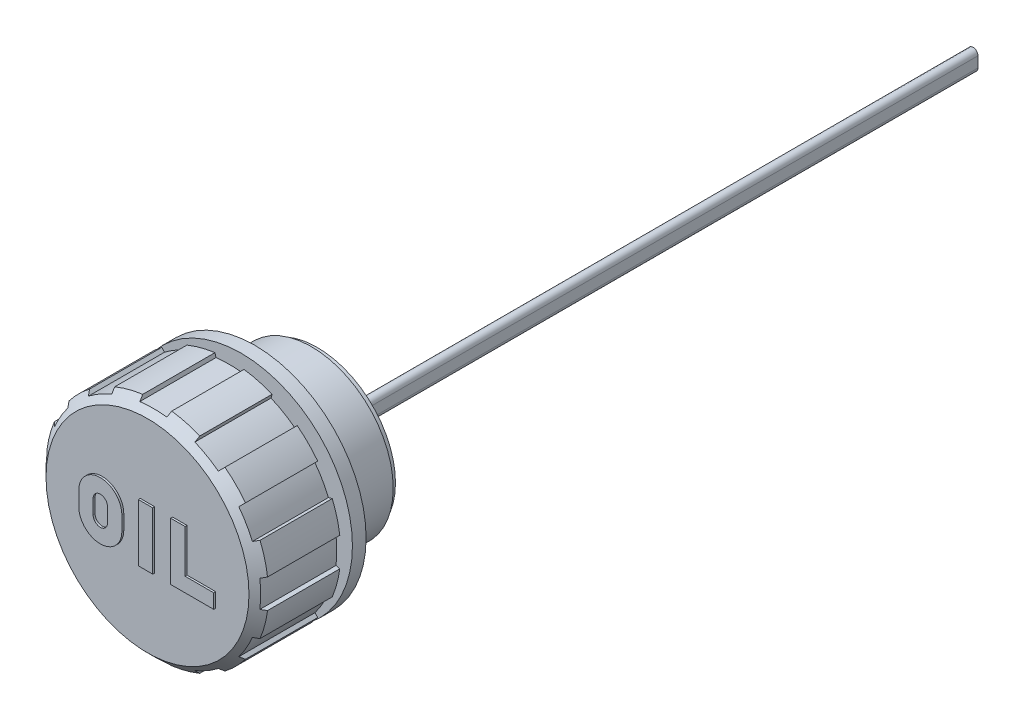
ISO-10303-21;
HEADER;
FILE_DESCRIPTION(('STEP AP214'),'2;1');
FILE_NAME('part.step','',(''),(''),'','','');
FILE_SCHEMA(('AUTOMOTIVE_DESIGN { 1 0 10303 214 1 1 1 1 }'));
ENDSEC;
DATA;
#1=APPLICATION_CONTEXT('core data for automotive mechanical design processes');
#2=APPLICATION_PROTOCOL_DEFINITION('international standard','automotive_design',2000,#1);
#3=PRODUCT_CONTEXT('',#1,'mechanical');
#4=PRODUCT('Part','Part','',(#3));
#5=PRODUCT_RELATED_PRODUCT_CATEGORY('part','',(#4));
#6=PRODUCT_DEFINITION_FORMATION('','',#4);
#7=PRODUCT_DEFINITION_CONTEXT('part definition',#1,'design');
#8=PRODUCT_DEFINITION('design','',#6,#7);
#9=PRODUCT_DEFINITION_SHAPE('','',#8);
#10=(LENGTH_UNIT() NAMED_UNIT(*) SI_UNIT(.MILLI.,.METRE.));
#11=(NAMED_UNIT(*) PLANE_ANGLE_UNIT() SI_UNIT($,.RADIAN.));
#12=(NAMED_UNIT(*) SI_UNIT($,.STERADIAN.) SOLID_ANGLE_UNIT());
#13=UNCERTAINTY_MEASURE_WITH_UNIT(LENGTH_MEASURE(1.E-05),#10,'distance_accuracy_value','');
#14=(GEOMETRIC_REPRESENTATION_CONTEXT(3) GLOBAL_UNCERTAINTY_ASSIGNED_CONTEXT((#13)) GLOBAL_UNIT_ASSIGNED_CONTEXT((#10,
#11,#12)) REPRESENTATION_CONTEXT('',''));
#15=CARTESIAN_POINT('',(0.,0.,0.));
#16=DIRECTION('',(0.,0.,1.));
#17=DIRECTION('',(1.,0.,0.));
#18=AXIS2_PLACEMENT_3D('',#15,#16,#17);
#19=CARTESIAN_POINT('',(-4.79158754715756E-13,-4.73970055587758E-13,-182.5));
#20=DIRECTION('',(0.,0.,1.));
#21=DIRECTION('',(1.,0.,0.));
#22=AXIS2_PLACEMENT_3D('',#19,#20,#21);
#23=PLANE('',#22);
#24=DIRECTION('',(0.,1.,0.));
#25=VECTOR('',#24,1.);
#26=CARTESIAN_POINT('',(-1.25000000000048,1.34999999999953,-182.5));
#27=LINE('',#26,#25);
#28=CARTESIAN_POINT('',(-1.25000000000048,1.34999999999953,-182.5));
#29=VERTEX_POINT('',#28);
#30=CARTESIAN_POINT('',(-1.25000000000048,-1.35000000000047,-182.5));
#31=VERTEX_POINT('',#30);
#32=EDGE_CURVE('E1985',#29,#31,#27,.F.);
#33=ORIENTED_EDGE('',*,*,#32,.F.);
#34=CARTESIAN_POINT('',(-4.79158754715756E-13,1.34999999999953,-182.5));
#35=DIRECTION('',(0.,0.,1.));
#36=DIRECTION('',(1.,0.,0.));
#37=AXIS2_PLACEMENT_3D('',#34,#35,#36);
#38=CIRCLE('',#37,1.25);
#39=CARTESIAN_POINT('',(1.24999999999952,1.34999999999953,-182.5));
#40=VERTEX_POINT('',#39);
#41=EDGE_CURVE('E1939',#40,#29,#38,.T.);
#42=ORIENTED_EDGE('',*,*,#41,.F.);
#43=DIRECTION('',(0.,1.,0.));
#44=VECTOR('',#43,1.);
#45=CARTESIAN_POINT('',(1.24999999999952,-1.35000000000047,-182.5));
#46=LINE('',#45,#44);
#47=CARTESIAN_POINT('',(1.24999999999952,-1.35000000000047,-182.5));
#48=VERTEX_POINT('',#47);
#49=EDGE_CURVE('E1983',#48,#40,#46,.T.);
#50=ORIENTED_EDGE('',*,*,#49,.F.);
#51=CARTESIAN_POINT('',(-4.79158754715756E-13,-1.35000000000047,-182.5));
#52=DIRECTION('',(0.,0.,1.));
#53=DIRECTION('',(1.,0.,0.));
#54=AXIS2_PLACEMENT_3D('',#51,#52,#53);
#55=CIRCLE('',#54,1.25);
#56=EDGE_CURVE('E480',#31,#48,#55,.T.);
#57=ORIENTED_EDGE('',*,*,#56,.F.);
#58=EDGE_LOOP('',(#33,#42,#50,#57));
#59=FACE_BOUND('',#58,.T.);
#60=ADVANCED_FACE('F14',(#59),#23,.F.);
#61=CARTESIAN_POINT('',(0.,-1.34999999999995,17.5));
#62=DIRECTION('',(0.,0.,1.));
#63=DIRECTION('',(1.,0.,0.));
#64=AXIS2_PLACEMENT_3D('',#61,#62,#63);
#65=CYLINDRICAL_SURFACE('',#64,1.25);
#66=ORIENTED_EDGE('',*,*,#56,.T.);
#67=DIRECTION('',(0.,0.,-1.));
#68=VECTOR('',#67,1.);
#69=CARTESIAN_POINT('',(1.25000000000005,-1.34999999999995,17.5));
#70=LINE('',#69,#68);
#71=CARTESIAN_POINT('',(1.25000000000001,-1.34999999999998,5.));
#72=VERTEX_POINT('',#71);
#73=EDGE_CURVE('E1938',#72,#48,#70,.T.);
#74=ORIENTED_EDGE('',*,*,#73,.F.);
#75=CARTESIAN_POINT('',(0.,-1.34999999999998,5.));
#76=DIRECTION('',(0.,0.,1.));
#77=DIRECTION('',(1.,0.,0.));
#78=AXIS2_PLACEMENT_3D('',#75,#76,#77);
#79=CIRCLE('',#78,1.25);
#80=CARTESIAN_POINT('',(-1.24999999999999,-1.34999999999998,5.));
#81=VERTEX_POINT('',#80);
#82=EDGE_CURVE('E1942',#81,#72,#79,.T.);
#83=ORIENTED_EDGE('',*,*,#82,.F.);
#84=DIRECTION('',(0.,0.,1.));
#85=VECTOR('',#84,1.);
#86=CARTESIAN_POINT('',(-1.24999999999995,-1.34999999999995,17.5));
#87=LINE('',#86,#85);
#88=EDGE_CURVE('E1946',#31,#81,#87,.T.);
#89=ORIENTED_EDGE('',*,*,#88,.F.);
#90=EDGE_LOOP('',(#66,#74,#83,#89));
#91=FACE_BOUND('',#90,.T.);
#92=ADVANCED_FACE('F2005',(#91),#65,.T.);
#93=CARTESIAN_POINT('',(1.25000000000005,-1.34999999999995,17.5));
#94=DIRECTION('',(1.,0.,0.));
#95=DIRECTION('',(0.,0.,-1.));
#96=AXIS2_PLACEMENT_3D('',#93,#94,#95);
#97=PLANE('',#96);
#98=ORIENTED_EDGE('',*,*,#49,.T.);
#99=DIRECTION('',(0.,0.,1.));
#100=VECTOR('',#99,1.);
#101=CARTESIAN_POINT('',(1.25000000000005,1.35000000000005,17.5));
#102=LINE('',#101,#100);
#103=CARTESIAN_POINT('',(1.25000000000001,1.35000000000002,5.));
#104=VERTEX_POINT('',#103);
#105=EDGE_CURVE('E1941',#104,#40,#102,.F.);
#106=ORIENTED_EDGE('',*,*,#105,.F.);
#107=DIRECTION('',(0.,1.,0.));
#108=VECTOR('',#107,1.);
#109=CARTESIAN_POINT('',(1.25000000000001,7.,5.));
#110=LINE('',#109,#108);
#111=EDGE_CURVE('E1945',#72,#104,#110,.T.);
#112=ORIENTED_EDGE('',*,*,#111,.F.);
#113=ORIENTED_EDGE('',*,*,#73,.T.);
#114=EDGE_LOOP('',(#98,#106,#112,#113));
#115=FACE_BOUND('',#114,.T.);
#116=ADVANCED_FACE('F2009',(#115),#97,.T.);
#117=CARTESIAN_POINT('',(0.,1.35000000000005,17.5));
#118=DIRECTION('',(0.,0.,1.));
#119=DIRECTION('',(1.,0.,0.));
#120=AXIS2_PLACEMENT_3D('',#117,#118,#119);
#121=CYLINDRICAL_SURFACE('',#120,1.25);
#122=ORIENTED_EDGE('',*,*,#41,.T.);
#123=DIRECTION('',(0.,0.,1.));
#124=VECTOR('',#123,1.);
#125=CARTESIAN_POINT('',(-1.24999999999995,1.35000000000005,17.5));
#126=LINE('',#125,#124);
#127=CARTESIAN_POINT('',(-1.24999999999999,1.35000000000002,5.));
#128=VERTEX_POINT('',#127);
#129=EDGE_CURVE('E33',#128,#29,#126,.F.);
#130=ORIENTED_EDGE('',*,*,#129,.F.);
#131=CARTESIAN_POINT('',(0.,1.35000000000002,5.));
#132=DIRECTION('',(0.,0.,1.));
#133=DIRECTION('',(1.,0.,0.));
#134=AXIS2_PLACEMENT_3D('',#131,#132,#133);
#135=CIRCLE('',#134,1.25);
#136=EDGE_CURVE('E1947',#104,#128,#135,.T.);
#137=ORIENTED_EDGE('',*,*,#136,.F.);
#138=ORIENTED_EDGE('',*,*,#105,.T.);
#139=EDGE_LOOP('',(#122,#130,#137,#138));
#140=FACE_BOUND('',#139,.T.);
#141=ADVANCED_FACE('F2011',(#140),#121,.T.);
#142=CARTESIAN_POINT('',(-1.24999999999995,1.35000000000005,17.5));
#143=DIRECTION('',(-1.,0.,0.));
#144=DIRECTION('',(0.,0.,1.));
#145=AXIS2_PLACEMENT_3D('',#142,#143,#144);
#146=PLANE('',#145);
#147=ORIENTED_EDGE('',*,*,#32,.T.);
#148=ORIENTED_EDGE('',*,*,#88,.T.);
#149=DIRECTION('',(0.,1.,0.));
#150=VECTOR('',#149,1.);
#151=CARTESIAN_POINT('',(-1.24999999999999,7.,5.));
#152=LINE('',#151,#150);
#153=EDGE_CURVE('E1950',#128,#81,#152,.F.);
#154=ORIENTED_EDGE('',*,*,#153,.F.);
#155=ORIENTED_EDGE('',*,*,#129,.T.);
#156=EDGE_LOOP('',(#147,#148,#154,#155));
#157=FACE_BOUND('',#156,.T.);
#158=ADVANCED_FACE('F2001',(#157),#146,.T.);
#159=CARTESIAN_POINT('',(0.,7.,5.));
#160=DIRECTION('',(0.,0.,-1.));
#161=DIRECTION('',(-1.,0.,0.));
#162=AXIS2_PLACEMENT_3D('',#159,#160,#161);
#163=PLANE('',#162);
#164=CARTESIAN_POINT('',(0.,0.,5.));
#165=DIRECTION('',(0.,0.,1.));
#166=DIRECTION('',(1.,0.,0.));
#167=AXIS2_PLACEMENT_3D('',#164,#165,#166);
#168=CIRCLE('',#167,14.);
#169=CARTESIAN_POINT('',(14.,0.,4.99999999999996));
#170=VERTEX_POINT('',#169);
#171=EDGE_CURVE('E1951',#170,#170,#168,.F.);
#172=ORIENTED_EDGE('',*,*,#171,.T.);
#173=EDGE_LOOP('',(#172));
#174=FACE_BOUND('',#173,.T.);
#175=ORIENTED_EDGE('',*,*,#136,.T.);
#176=ORIENTED_EDGE('',*,*,#153,.T.);
#177=ORIENTED_EDGE('',*,*,#82,.T.);
#178=ORIENTED_EDGE('',*,*,#111,.T.);
#179=EDGE_LOOP('',(#175,#176,#177,#178));
#180=FACE_BOUND('',#179,.T.);
#181=ADVANCED_FACE('F1999',(#174,#180),#163,.T.);
#182=CARTESIAN_POINT('',(0.,0.,-4.75));
#183=DIRECTION('',(0.,0.,1.));
#184=DIRECTION('',(1.,0.,0.));
#185=AXIS2_PLACEMENT_3D('',#182,#183,#184);
#186=CYLINDRICAL_SURFACE('',#185,14.);
#187=ORIENTED_EDGE('',*,*,#171,.F.);
#188=EDGE_LOOP('',(#187));
#189=FACE_BOUND('',#188,.T.);
#190=CARTESIAN_POINT('',(0.,0.,-14.5));
#191=DIRECTION('',(0.,0.,1.));
#192=DIRECTION('',(1.,0.,0.));
#193=AXIS2_PLACEMENT_3D('',#190,#191,#192);
#194=CIRCLE('',#193,14.);
#195=CARTESIAN_POINT('',(14.,0.,-14.5));
#196=VERTEX_POINT('',#195);
#197=EDGE_CURVE('E1954',#196,#196,#194,.T.);
#198=ORIENTED_EDGE('',*,*,#197,.F.);
#199=EDGE_LOOP('',(#198));
#200=FACE_BOUND('',#199,.T.);
#201=ADVANCED_FACE('F2057',(#189,#200),#186,.F.);
#202=CARTESIAN_POINT('',(0.,17.01242375,-14.5));
#203=DIRECTION('',(0.,0.,-1.));
#204=DIRECTION('',(-1.,0.,0.));
#205=AXIS2_PLACEMENT_3D('',#202,#203,#204);
#206=PLANE('',#205);
#207=CARTESIAN_POINT('',(0.,0.,-14.5));
#208=DIRECTION('',(0.,0.,1.));
#209=DIRECTION('',(1.,0.,0.));
#210=AXIS2_PLACEMENT_3D('',#207,#208,#209);
#211=CIRCLE('',#210,20.0248475);
#212=CARTESIAN_POINT('',(20.0248475,0.,-14.5000000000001));
#213=VERTEX_POINT('',#212);
#214=EDGE_CURVE('E1957',#213,#213,#211,.T.);
#215=ORIENTED_EDGE('',*,*,#214,.F.);
#216=EDGE_LOOP('',(#215));
#217=FACE_BOUND('',#216,.T.);
#218=ORIENTED_EDGE('',*,*,#197,.T.);
#219=EDGE_LOOP('',(#218));
#220=FACE_BOUND('',#219,.T.);
#221=ADVANCED_FACE('F2066',(#217,#220),#206,.T.);
#222=CARTESIAN_POINT('',(0.,0.,-13.75));
#223=DIRECTION('',(0.,0.,1.));
#224=DIRECTION('',(1.,0.,0.));
#225=AXIS2_PLACEMENT_3D('',#222,#223,#224);
#226=CYLINDRICAL_SURFACE('',#225,20.0248475);
#227=ORIENTED_EDGE('',*,*,#214,.T.);
#228=EDGE_LOOP('',(#227));
#229=FACE_BOUND('',#228,.T.);
#230=CARTESIAN_POINT('',(0.,0.,-13.));
#231=DIRECTION('',(0.,0.,1.));
#232=DIRECTION('',(1.,0.,0.));
#233=AXIS2_PLACEMENT_3D('',#230,#231,#232);
#234=CIRCLE('',#233,20.0248475);
#235=CARTESIAN_POINT('',(20.0248475,0.,-13.0000000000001));
#236=VERTEX_POINT('',#235);
#237=EDGE_CURVE('E1960',#236,#236,#234,.T.);
#238=ORIENTED_EDGE('',*,*,#237,.F.);
#239=EDGE_LOOP('',(#238));
#240=FACE_BOUND('',#239,.T.);
#241=ADVANCED_FACE('F2076',(#229,#240),#226,.T.);
#242=CARTESIAN_POINT('',(0.,20.48492375,-13.));
#243=DIRECTION('',(0.,0.,-1.));
#244=DIRECTION('',(-1.,0.,0.));
#245=AXIS2_PLACEMENT_3D('',#242,#243,#244);
#246=PLANE('',#245);
#247=CARTESIAN_POINT('',(0.,0.,-13.));
#248=DIRECTION('',(0.,0.,1.));
#249=DIRECTION('',(1.,0.,0.));
#250=AXIS2_PLACEMENT_3D('',#247,#248,#249);
#251=CIRCLE('',#250,20.945);
#252=CARTESIAN_POINT('',(20.945,0.,-13.0000000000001));
#253=VERTEX_POINT('',#252);
#254=EDGE_CURVE('E1963',#253,#253,#251,.T.);
#255=ORIENTED_EDGE('',*,*,#254,.F.);
#256=EDGE_LOOP('',(#255));
#257=FACE_BOUND('',#256,.T.);
#258=ORIENTED_EDGE('',*,*,#237,.T.);
#259=EDGE_LOOP('',(#258));
#260=FACE_BOUND('',#259,.T.);
#261=ADVANCED_FACE('F2086',(#257,#260),#246,.T.);
#262=CARTESIAN_POINT('',(0.,0.,-6.5));
#263=DIRECTION('',(0.,0.,1.));
#264=DIRECTION('',(1.,0.,0.));
#265=AXIS2_PLACEMENT_3D('',#262,#263,#264);
#266=CYLINDRICAL_SURFACE('',#265,20.945);
#267=ORIENTED_EDGE('',*,*,#254,.T.);
#268=EDGE_LOOP('',(#267));
#269=FACE_BOUND('',#268,.T.);
#270=CARTESIAN_POINT('',(0.,0.,0.));
#271=DIRECTION('',(0.,0.,1.));
#272=DIRECTION('',(1.,0.,0.));
#273=AXIS2_PLACEMENT_3D('',#270,#271,#272);
#274=CIRCLE('',#273,20.945);
#275=CARTESIAN_POINT('',(20.945,0.,0.));
#276=VERTEX_POINT('',#275);
#277=EDGE_CURVE('E1966',#276,#276,#274,.T.);
#278=ORIENTED_EDGE('',*,*,#277,.F.);
#279=EDGE_LOOP('',(#278));
#280=FACE_BOUND('',#279,.T.);
#281=ADVANCED_FACE('F2096',(#269,#280),#266,.T.);
#282=CARTESIAN_POINT('',(0.,23.4270454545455,0.));
#283=DIRECTION('',(0.,0.,-1.));
#284=DIRECTION('',(0.,-1.,0.));
#285=AXIS2_PLACEMENT_3D('',#282,#283,#284);
#286=PLANE('',#285);
#287=CARTESIAN_POINT('',(0.,0.,0.));
#288=DIRECTION('',(0.,0.,1.));
#289=DIRECTION('',(1.,0.,0.));
#290=AXIS2_PLACEMENT_3D('',#287,#288,#289);
#291=CIRCLE('',#290,25.9090909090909);
#292=CARTESIAN_POINT('',(25.9090909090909,0.,0.));
#293=VERTEX_POINT('',#292);
#294=EDGE_CURVE('E1969',#293,#293,#291,.T.);
#295=ORIENTED_EDGE('',*,*,#294,.F.);
#296=EDGE_LOOP('',(#295));
#297=FACE_BOUND('',#296,.T.);
#298=ORIENTED_EDGE('',*,*,#277,.T.);
#299=EDGE_LOOP('',(#298));
#300=FACE_BOUND('',#299,.T.);
#301=ADVANCED_FACE('F2106',(#297,#300),#286,.T.);
#302=CARTESIAN_POINT('',(0.,0.,0.75));
#303=DIRECTION('',(0.,0.,1.));
#304=DIRECTION('',(1.,0.,0.));
#305=AXIS2_PLACEMENT_3D('',#302,#303,#304);
#306=CYLINDRICAL_SURFACE('',#305,25.9090909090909);
#307=ORIENTED_EDGE('',*,*,#294,.T.);
#308=EDGE_LOOP('',(#307));
#309=FACE_BOUND('',#308,.T.);
#310=CARTESIAN_POINT('',(0.,0.,1.5));
#311=DIRECTION('',(0.,0.,1.));
#312=DIRECTION('',(1.,0.,0.));
#313=AXIS2_PLACEMENT_3D('',#310,#311,#312);
#314=CIRCLE('',#313,25.9090909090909);
#315=CARTESIAN_POINT('',(25.9090909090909,0.,1.49999999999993));
#316=VERTEX_POINT('',#315);
#317=EDGE_CURVE('E1972',#316,#316,#314,.T.);
#318=ORIENTED_EDGE('',*,*,#317,.F.);
#319=EDGE_LOOP('',(#318));
#320=FACE_BOUND('',#319,.T.);
#321=ADVANCED_FACE('F2116',(#309,#320),#306,.T.);
#322=CARTESIAN_POINT('',(0.,27.2045454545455,1.49999999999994));
#323=DIRECTION('',(0.,0.,-1.));
#324=DIRECTION('',(-1.,0.,0.));
#325=AXIS2_PLACEMENT_3D('',#322,#323,#324);
#326=PLANE('',#325);
#327=CARTESIAN_POINT('',(0.,0.,1.5));
#328=DIRECTION('',(0.,0.,1.));
#329=DIRECTION('',(1.,0.,0.));
#330=AXIS2_PLACEMENT_3D('',#327,#328,#329);
#331=CIRCLE('',#330,28.5);
#332=CARTESIAN_POINT('',(28.5,0.,1.49999999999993));
#333=VERTEX_POINT('',#332);
#334=EDGE_CURVE('E1975',#333,#333,#331,.T.);
#335=ORIENTED_EDGE('',*,*,#334,.F.);
#336=EDGE_LOOP('',(#335));
#337=FACE_BOUND('',#336,.T.);
#338=ORIENTED_EDGE('',*,*,#317,.T.);
#339=EDGE_LOOP('',(#338));
#340=FACE_BOUND('',#339,.T.);
#341=ADVANCED_FACE('F2126',(#337,#340),#326,.T.);
#342=CARTESIAN_POINT('',(0.,0.,3.25));
#343=DIRECTION('',(0.,0.,1.));
#344=DIRECTION('',(1.,0.,0.));
#345=AXIS2_PLACEMENT_3D('',#342,#343,#344);
#346=CYLINDRICAL_SURFACE('',#345,28.5);
#347=ORIENTED_EDGE('',*,*,#334,.T.);
#348=EDGE_LOOP('',(#347));
#349=FACE_BOUND('',#348,.T.);
#350=CARTESIAN_POINT('',(0.,0.,5.));
#351=DIRECTION('',(0.,0.,1.));
#352=DIRECTION('',(1.,0.,0.));
#353=AXIS2_PLACEMENT_3D('',#350,#351,#352);
#354=CIRCLE('',#353,28.5);
#355=CARTESIAN_POINT('',(28.5,0.,4.99999999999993));
#356=VERTEX_POINT('',#355);
#357=EDGE_CURVE('E1978',#356,#356,#354,.T.);
#358=ORIENTED_EDGE('',*,*,#357,.F.);
#359=EDGE_LOOP('',(#358));
#360=FACE_BOUND('',#359,.T.);
#361=ADVANCED_FACE('F2136',(#349,#360),#346,.T.);
#362=CARTESIAN_POINT('',(0.,23.75,5.));
#363=DIRECTION('',(0.,0.,1.));
#364=DIRECTION('',(1.,0.,0.));
#365=AXIS2_PLACEMENT_3D('',#362,#363,#364);
#366=PLANE('',#365);
#367=CARTESIAN_POINT('',(0.,0.,5.));
#368=DIRECTION('',(0.,0.,1.));
#369=DIRECTION('',(1.,0.,0.));
#370=AXIS2_PLACEMENT_3D('',#367,#368,#369);
#371=CIRCLE('',#370,19.);
#372=CARTESIAN_POINT('',(19.,0.,4.99999999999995));
#373=VERTEX_POINT('',#372);
#374=EDGE_CURVE('E24',#373,#373,#371,.T.);
#375=ORIENTED_EDGE('',*,*,#374,.F.);
#376=EDGE_LOOP('',(#375));
#377=FACE_BOUND('',#376,.T.);
#378=ORIENTED_EDGE('',*,*,#357,.T.);
#379=EDGE_LOOP('',(#378));
#380=FACE_BOUND('',#379,.T.);
#381=ADVANCED_FACE('F2146',(#377,#380),#366,.T.);
#382=CARTESIAN_POINT('',(0.,0.,6.5));
#383=DIRECTION('',(0.,0.,1.));
#384=DIRECTION('',(1.,0.,0.));
#385=AXIS2_PLACEMENT_3D('',#382,#383,#384);
#386=CYLINDRICAL_SURFACE('',#385,19.);
#387=ORIENTED_EDGE('',*,*,#374,.T.);
#388=EDGE_LOOP('',(#387));
#389=FACE_BOUND('',#388,.T.);
#390=CARTESIAN_POINT('',(0.,0.,8.));
#391=DIRECTION('',(0.,0.,1.));
#392=DIRECTION('',(1.,0.,0.));
#393=AXIS2_PLACEMENT_3D('',#390,#391,#392);
#394=CIRCLE('',#393,19.);
#395=CARTESIAN_POINT('',(19.,0.,7.99999999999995));
#396=VERTEX_POINT('',#395);
#397=EDGE_CURVE('E9',#396,#396,#394,.T.);
#398=ORIENTED_EDGE('',*,*,#397,.F.);
#399=EDGE_LOOP('',(#398));
#400=FACE_BOUND('',#399,.T.);
#401=ADVANCED_FACE('F2156',(#389,#400),#386,.T.);
#402=CARTESIAN_POINT('',(0.,20.9,8.));
#403=DIRECTION('',(0.,0.,-1.));
#404=DIRECTION('',(-1.,0.,0.));
#405=AXIS2_PLACEMENT_3D('',#402,#403,#404);
#406=PLANE('',#405);
#407=ORIENTED_EDGE('',*,*,#397,.T.);
#408=EDGE_LOOP('',(#407));
#409=FACE_BOUND('',#408,.T.);
#410=DIRECTION('',(-0.965925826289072,0.258819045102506,0.));
#411=VECTOR('',#410,1.);
#412=CARTESIAN_POINT('',(-27.2816105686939,3.4588617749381,8.));
#413=LINE('',#412,#411);
#414=CARTESIAN_POINT('',(-27.2816105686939,3.4588617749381,8.));
#415=VERTEX_POINT('',#414);
#416=CARTESIAN_POINT('',(-28.2561785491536,3.7199964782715,8.));
#417=VERTEX_POINT('',#416);
#418=EDGE_CURVE('E919',#415,#417,#413,.T.);
#419=ORIENTED_EDGE('',*,*,#418,.T.);
#420=CARTESIAN_POINT('',(0.,-1.19468342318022E-13,8.));
#421=DIRECTION('',(0.,0.,1.));
#422=DIRECTION('',(1.,0.,0.));
#423=AXIS2_PLACEMENT_3D('',#420,#421,#422);
#424=CIRCLE('',#423,28.5);
#425=CARTESIAN_POINT('',(-26.3305666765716,10.9064778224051,8.));
#426=VERTEX_POINT('',#425);
#427=EDGE_CURVE('E533',#426,#417,#424,.T.);
#428=ORIENTED_EDGE('',*,*,#427,.F.);
#429=DIRECTION('',(0.96592582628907,-0.258819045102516,0.));
#430=VECTOR('',#429,1.);
#431=CARTESIAN_POINT('',(-26.3305666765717,10.9064778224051,8.));
#432=LINE('',#431,#430);
#433=CARTESIAN_POINT('',(-25.355998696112,10.6453431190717,8.));
#434=VERTEX_POINT('',#433);
#435=EDGE_CURVE('E962',#426,#434,#432,.T.);
#436=ORIENTED_EDGE('',*,*,#435,.T.);
#437=CARTESIAN_POINT('',(0.,0.,8.));
#438=DIRECTION('',(0.,0.,1.));
#439=DIRECTION('',(1.,0.,0.));
#440=AXIS2_PLACEMENT_3D('',#437,#438,#439);
#441=CIRCLE('',#440,27.5);
#442=CARTESIAN_POINT('',(-21.8971369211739,16.6362674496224,8.));
#443=VERTEX_POINT('',#442);
#444=EDGE_CURVE('E538',#443,#434,#441,.T.);
#445=ORIENTED_EDGE('',*,*,#444,.F.);
#446=DIRECTION('',(-0.707106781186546,0.707106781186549,0.));
#447=VECTOR('',#446,1.);
#448=CARTESIAN_POINT('',(-21.8971369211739,16.6362674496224,8.));
#449=LINE('',#448,#447);
#450=CARTESIAN_POINT('',(-22.6105701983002,17.3497007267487,8.));
#451=VERTEX_POINT('',#450);
#452=EDGE_CURVE('E960',#443,#451,#449,.T.);
#453=ORIENTED_EDGE('',*,*,#452,.T.);
#454=CARTESIAN_POINT('',(-1.1755161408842E-13,0.,8.));
#455=DIRECTION('',(0.,0.,1.));
#456=DIRECTION('',(1.,0.,0.));
#457=AXIS2_PLACEMENT_3D('',#454,#455,#456);
#458=CIRCLE('',#457,28.5);
#459=CARTESIAN_POINT('',(-17.3497007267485,22.6105701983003,8.));
#460=VERTEX_POINT('',#459);
#461=EDGE_CURVE('E543',#460,#451,#458,.T.);
#462=ORIENTED_EDGE('',*,*,#461,.F.);
#463=DIRECTION('',(0.707106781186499,-0.707106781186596,0.));
#464=VECTOR('',#463,1.);
#465=CARTESIAN_POINT('',(-17.3497007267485,22.6105701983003,8.));
#466=LINE('',#465,#464);
#467=CARTESIAN_POINT('',(-16.6362674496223,21.8971369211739,8.));
#468=VERTEX_POINT('',#467);
#469=EDGE_CURVE('E958',#460,#468,#466,.T.);
#470=ORIENTED_EDGE('',*,*,#469,.T.);
#471=CARTESIAN_POINT('',(0.,0.,8.));
#472=DIRECTION('',(0.,0.,1.));
#473=DIRECTION('',(1.,0.,0.));
#474=AXIS2_PLACEMENT_3D('',#471,#472,#473);
#475=CIRCLE('',#474,27.5);
#476=CARTESIAN_POINT('',(-10.6453431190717,25.355998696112,8.));
#477=VERTEX_POINT('',#476);
#478=EDGE_CURVE('E548',#477,#468,#475,.T.);
#479=ORIENTED_EDGE('',*,*,#478,.F.);
#480=DIRECTION('',(-0.258819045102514,0.96592582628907,0.));
#481=VECTOR('',#480,1.);
#482=CARTESIAN_POINT('',(-10.6453431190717,25.355998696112,8.));
#483=LINE('',#482,#481);
#484=CARTESIAN_POINT('',(-10.9064778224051,26.3305666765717,8.));
#485=VERTEX_POINT('',#484);
#486=EDGE_CURVE('E956',#477,#485,#483,.T.);
#487=ORIENTED_EDGE('',*,*,#486,.T.);
#488=CARTESIAN_POINT('',(-1.59740089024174E-13,4.52518559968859E-13,8.));
#489=DIRECTION('',(0.,0.,1.));
#490=DIRECTION('',(1.,0.,0.));
#491=AXIS2_PLACEMENT_3D('',#488,#489,#490);
#492=CIRCLE('',#491,28.4999999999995);
#493=CARTESIAN_POINT('',(-3.71999647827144,28.2561785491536,8.));
#494=VERTEX_POINT('',#493);
#495=EDGE_CURVE('E553',#494,#485,#492,.T.);
#496=ORIENTED_EDGE('',*,*,#495,.F.);
#497=DIRECTION('',(0.258819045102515,-0.96592582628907,0.));
#498=VECTOR('',#497,1.);
#499=CARTESIAN_POINT('',(-3.71999647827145,28.2561785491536,8.));
#500=LINE('',#499,#498);
#501=CARTESIAN_POINT('',(-3.45886177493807,27.281610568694,8.));
#502=VERTEX_POINT('',#501);
#503=EDGE_CURVE('E954',#494,#502,#500,.T.);
#504=ORIENTED_EDGE('',*,*,#503,.T.);
#505=CARTESIAN_POINT('',(0.,-1.37231910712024E-13,8.));
#506=DIRECTION('',(0.,0.,1.));
#507=DIRECTION('',(1.,0.,0.));
#508=AXIS2_PLACEMENT_3D('',#505,#506,#507);
#509=CIRCLE('',#508,27.5);
#510=CARTESIAN_POINT('',(3.4588617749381,27.281610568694,8.));
#511=VERTEX_POINT('',#510);
#512=EDGE_CURVE('E558',#511,#502,#509,.T.);
#513=ORIENTED_EDGE('',*,*,#512,.F.);
#514=DIRECTION('',(0.258819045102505,0.965925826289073,0.));
#515=VECTOR('',#514,1.);
#516=CARTESIAN_POINT('',(3.45886177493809,27.2816105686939,8.));
#517=LINE('',#516,#515);
#518=CARTESIAN_POINT('',(3.71999647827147,28.2561785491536,8.));
#519=VERTEX_POINT('',#518);
#520=EDGE_CURVE('E952',#511,#519,#517,.T.);
#521=ORIENTED_EDGE('',*,*,#520,.T.);
#522=CARTESIAN_POINT('',(0.,-3.36183876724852E-13,8.));
#523=DIRECTION('',(0.,0.,1.));
#524=DIRECTION('',(1.,0.,0.));
#525=AXIS2_PLACEMENT_3D('',#522,#523,#524);
#526=CIRCLE('',#525,28.5);
#527=CARTESIAN_POINT('',(10.9064778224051,26.3305666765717,7.99999999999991));
#528=VERTEX_POINT('',#527);
#529=EDGE_CURVE('E563',#528,#519,#526,.T.);
#530=ORIENTED_EDGE('',*,*,#529,.F.);
#531=DIRECTION('',(-0.258819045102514,-0.96592582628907,0.));
#532=VECTOR('',#531,1.);
#533=CARTESIAN_POINT('',(10.9064778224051,26.3305666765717,7.99999999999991));
#534=LINE('',#533,#532);
#535=CARTESIAN_POINT('',(10.6453431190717,25.355998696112,7.99999999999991));
#536=VERTEX_POINT('',#535);
#537=EDGE_CURVE('E950',#528,#536,#534,.T.);
#538=ORIENTED_EDGE('',*,*,#537,.T.);
#539=CARTESIAN_POINT('',(1.87981762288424E-13,4.24096850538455E-13,8.));
#540=DIRECTION('',(0.,0.,1.));
#541=DIRECTION('',(1.,0.,0.));
#542=AXIS2_PLACEMENT_3D('',#539,#540,#541);
#543=CIRCLE('',#542,27.4999999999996);
#544=CARTESIAN_POINT('',(16.6362674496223,21.8971369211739,7.9999999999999));
#545=VERTEX_POINT('',#544);
#546=EDGE_CURVE('E568',#545,#536,#543,.T.);
#547=ORIENTED_EDGE('',*,*,#546,.F.);
#548=DIRECTION('',(0.707106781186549,0.707106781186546,0.));
#549=VECTOR('',#548,1.);
#550=CARTESIAN_POINT('',(16.6362674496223,21.8971369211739,7.9999999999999));
#551=LINE('',#550,#549);
#552=CARTESIAN_POINT('',(17.3497007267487,22.6105701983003,7.9999999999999));
#553=VERTEX_POINT('',#552);
#554=EDGE_CURVE('E948',#545,#553,#551,.T.);
#555=ORIENTED_EDGE('',*,*,#554,.T.);
#556=CARTESIAN_POINT('',(0.,0.,8.));
#557=DIRECTION('',(0.,0.,1.));
#558=DIRECTION('',(1.,0.,0.));
#559=AXIS2_PLACEMENT_3D('',#556,#557,#558);
#560=CIRCLE('',#559,28.5);
#561=CARTESIAN_POINT('',(22.6105701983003,17.3497007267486,7.9999999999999));
#562=VERTEX_POINT('',#561);
#563=EDGE_CURVE('E573',#562,#553,#560,.T.);
#564=ORIENTED_EDGE('',*,*,#563,.F.);
#565=DIRECTION('',(-0.707106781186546,-0.707106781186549,0.));
#566=VECTOR('',#565,1.);
#567=CARTESIAN_POINT('',(22.6105701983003,17.3497007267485,7.9999999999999));
#568=LINE('',#567,#566);
#569=CARTESIAN_POINT('',(21.897136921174,16.6362674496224,7.9999999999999));
#570=VERTEX_POINT('',#569);
#571=EDGE_CURVE('E946',#562,#570,#568,.T.);
#572=ORIENTED_EDGE('',*,*,#571,.T.);
#573=CARTESIAN_POINT('',(0.,0.,8.));
#574=DIRECTION('',(0.,0.,1.));
#575=DIRECTION('',(1.,0.,0.));
#576=AXIS2_PLACEMENT_3D('',#573,#574,#575);
#577=CIRCLE('',#576,27.5);
#578=CARTESIAN_POINT('',(25.355998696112,10.6453431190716,7.99999999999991));
#579=VERTEX_POINT('',#578);
#580=EDGE_CURVE('E578',#579,#570,#577,.T.);
#581=ORIENTED_EDGE('',*,*,#580,.F.);
#582=DIRECTION('',(0.965925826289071,0.258819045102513,0.));
#583=VECTOR('',#582,1.);
#584=CARTESIAN_POINT('',(25.355998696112,10.6453431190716,7.99999999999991));
#585=LINE('',#584,#583);
#586=CARTESIAN_POINT('',(26.3305666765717,10.906477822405,7.99999999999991));
#587=VERTEX_POINT('',#586);
#588=EDGE_CURVE('E944',#579,#587,#585,.T.);
#589=ORIENTED_EDGE('',*,*,#588,.T.);
#590=CARTESIAN_POINT('',(0.,0.,8.));
#591=DIRECTION('',(0.,0.,1.));
#592=DIRECTION('',(1.,0.,0.));
#593=AXIS2_PLACEMENT_3D('',#590,#591,#592);
#594=CIRCLE('',#593,28.5);
#595=CARTESIAN_POINT('',(28.2561785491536,3.71999647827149,8.));
#596=VERTEX_POINT('',#595);
#597=EDGE_CURVE('E583',#596,#587,#594,.T.);
#598=ORIENTED_EDGE('',*,*,#597,.F.);
#599=DIRECTION('',(-0.965925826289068,-0.258819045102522,0.));
#600=VECTOR('',#599,1.);
#601=CARTESIAN_POINT('',(28.2561785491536,3.71999647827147,8.));
#602=LINE('',#601,#600);
#603=CARTESIAN_POINT('',(27.2816105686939,3.45886177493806,8.));
#604=VERTEX_POINT('',#603);
#605=EDGE_CURVE('E942',#596,#604,#602,.T.);
#606=ORIENTED_EDGE('',*,*,#605,.T.);
#607=CARTESIAN_POINT('',(-1.2110432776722E-13,0.,8.));
#608=DIRECTION('',(0.,0.,1.));
#609=DIRECTION('',(1.,0.,0.));
#610=AXIS2_PLACEMENT_3D('',#607,#608,#609);
#611=CIRCLE('',#610,27.5);
#612=CARTESIAN_POINT('',(27.2816105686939,-3.45886177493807,8.));
#613=VERTEX_POINT('',#612);
#614=EDGE_CURVE('E588',#613,#604,#611,.T.);
#615=ORIENTED_EDGE('',*,*,#614,.F.);
#616=DIRECTION('',(0.965925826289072,-0.258819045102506,0.));
#617=VECTOR('',#616,1.);
#618=CARTESIAN_POINT('',(27.2816105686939,-3.45886177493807,8.));
#619=LINE('',#618,#617);
#620=CARTESIAN_POINT('',(28.2561785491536,-3.71999647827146,8.));
#621=VERTEX_POINT('',#620);
#622=EDGE_CURVE('E940',#613,#621,#619,.T.);
#623=ORIENTED_EDGE('',*,*,#622,.T.);
#624=CARTESIAN_POINT('',(1.27585629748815E-13,0.,8.));
#625=DIRECTION('',(0.,0.,1.));
#626=DIRECTION('',(1.,0.,0.));
#627=AXIS2_PLACEMENT_3D('',#624,#625,#626);
#628=CIRCLE('',#627,28.5);
#629=CARTESIAN_POINT('',(26.3305666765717,-10.9064778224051,8.));
#630=VERTEX_POINT('',#629);
#631=EDGE_CURVE('E593',#630,#621,#628,.T.);
#632=ORIENTED_EDGE('',*,*,#631,.F.);
#633=DIRECTION('',(-0.96592582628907,0.258819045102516,0.));
#634=VECTOR('',#633,1.);
#635=CARTESIAN_POINT('',(26.3305666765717,-10.9064778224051,8.));
#636=LINE('',#635,#634);
#637=CARTESIAN_POINT('',(25.355998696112,-10.6453431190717,8.));
#638=VERTEX_POINT('',#637);
#639=EDGE_CURVE('E938',#630,#638,#636,.T.);
#640=ORIENTED_EDGE('',*,*,#639,.T.);
#641=CARTESIAN_POINT('',(0.,2.42908452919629E-13,8.));
#642=DIRECTION('',(0.,0.,1.));
#643=DIRECTION('',(1.,0.,0.));
#644=AXIS2_PLACEMENT_3D('',#641,#642,#643);
#645=CIRCLE('',#644,27.5);
#646=CARTESIAN_POINT('',(21.8971369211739,-16.6362674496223,8.));
#647=VERTEX_POINT('',#646);
#648=EDGE_CURVE('E598',#647,#638,#645,.T.);
#649=ORIENTED_EDGE('',*,*,#648,.F.);
#650=DIRECTION('',(0.707106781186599,-0.707106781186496,0.));
#651=VECTOR('',#650,1.);
#652=CARTESIAN_POINT('',(21.8971369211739,-16.6362674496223,8.));
#653=LINE('',#652,#651);
#654=CARTESIAN_POINT('',(22.6105701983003,-17.3497007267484,8.));
#655=VERTEX_POINT('',#654);
#656=EDGE_CURVE('E936',#647,#655,#653,.T.);
#657=ORIENTED_EDGE('',*,*,#656,.T.);
#658=CARTESIAN_POINT('',(1.13374775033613E-13,-1.0525748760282E-13,8.));
#659=DIRECTION('',(0.,0.,1.));
#660=DIRECTION('',(1.,0.,0.));
#661=AXIS2_PLACEMENT_3D('',#658,#659,#660);
#662=CIRCLE('',#661,28.5);
#663=CARTESIAN_POINT('',(17.3497007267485,-22.6105701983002,8.));
#664=VERTEX_POINT('',#663);
#665=EDGE_CURVE('E603',#664,#655,#662,.T.);
#666=ORIENTED_EDGE('',*,*,#665,.F.);
#667=DIRECTION('',(-0.707106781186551,0.707106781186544,0.));
#668=VECTOR('',#667,1.);
#669=CARTESIAN_POINT('',(17.3497007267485,-22.6105701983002,8.));
#670=LINE('',#669,#668);
#671=CARTESIAN_POINT('',(16.6362674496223,-21.8971369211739,8.));
#672=VERTEX_POINT('',#671);
#673=EDGE_CURVE('E934',#664,#672,#670,.T.);
#674=ORIENTED_EDGE('',*,*,#673,.T.);
#675=CARTESIAN_POINT('',(4.42000790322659E-13,-2.4381332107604E-13,8.));
#676=DIRECTION('',(0.,0.,1.));
#677=DIRECTION('',(1.,0.,0.));
#678=AXIS2_PLACEMENT_3D('',#675,#676,#677);
#679=CIRCLE('',#678,27.4999999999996);
#680=CARTESIAN_POINT('',(10.6453431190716,-25.355998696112,8.));
#681=VERTEX_POINT('',#680);
#682=EDGE_CURVE('E608',#681,#672,#679,.T.);
#683=ORIENTED_EDGE('',*,*,#682,.F.);
#684=DIRECTION('',(0.258819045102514,-0.96592582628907,0.));
#685=VECTOR('',#684,1.);
#686=CARTESIAN_POINT('',(10.6453431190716,-25.3559986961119,8.));
#687=LINE('',#686,#685);
#688=CARTESIAN_POINT('',(10.906477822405,-26.3305666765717,8.));
#689=VERTEX_POINT('',#688);
#690=EDGE_CURVE('E885',#681,#689,#687,.T.);
#691=ORIENTED_EDGE('',*,*,#690,.T.);
#692=CARTESIAN_POINT('',(0.,-2.65129603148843E-13,8.));
#693=DIRECTION('',(0.,0.,1.));
#694=DIRECTION('',(1.,0.,0.));
#695=AXIS2_PLACEMENT_3D('',#692,#693,#694);
#696=CIRCLE('',#695,28.5);
#697=CARTESIAN_POINT('',(3.71999647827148,-28.2561785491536,8.));
#698=VERTEX_POINT('',#697);
#699=EDGE_CURVE('E613',#698,#689,#696,.T.);
#700=ORIENTED_EDGE('',*,*,#699,.F.);
#701=DIRECTION('',(-0.258819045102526,0.965925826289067,0.));
#702=VECTOR('',#701,1.);
#703=CARTESIAN_POINT('',(3.71999647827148,-28.2561785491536,8.));
#704=LINE('',#703,#702);
#705=CARTESIAN_POINT('',(3.45886177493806,-27.2816105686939,8.));
#706=VERTEX_POINT('',#705);
#707=EDGE_CURVE('E632',#698,#706,#704,.T.);
#708=ORIENTED_EDGE('',*,*,#707,.T.);
#709=CARTESIAN_POINT('',(0.,1.64748751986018E-13,8.));
#710=DIRECTION('',(0.,0.,1.));
#711=DIRECTION('',(1.,0.,0.));
#712=AXIS2_PLACEMENT_3D('',#709,#710,#711);
#713=CIRCLE('',#712,27.5);
#714=CARTESIAN_POINT('',(-3.45886177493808,-27.2816105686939,8.00000000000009));
#715=VERTEX_POINT('',#714);
#716=EDGE_CURVE('E498',#715,#706,#713,.T.);
#717=ORIENTED_EDGE('',*,*,#716,.F.);
#718=DIRECTION('',(-0.258819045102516,-0.96592582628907,0.));
#719=VECTOR('',#718,1.);
#720=CARTESIAN_POINT('',(-3.45886177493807,-27.2816105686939,8.00000000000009));
#721=LINE('',#720,#719);
#722=CARTESIAN_POINT('',(-3.71999647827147,-28.2561785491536,8.00000000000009));
#723=VERTEX_POINT('',#722);
#724=EDGE_CURVE('E931',#715,#723,#721,.T.);
#725=ORIENTED_EDGE('',*,*,#724,.T.);
#726=CARTESIAN_POINT('',(0.,-2.82893171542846E-13,8.));
#727=DIRECTION('',(0.,0.,1.));
#728=DIRECTION('',(1.,0.,0.));
#729=AXIS2_PLACEMENT_3D('',#726,#727,#728);
#730=CIRCLE('',#729,28.5);
#731=CARTESIAN_POINT('',(-10.9064778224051,-26.3305666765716,8.0000000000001));
#732=VERTEX_POINT('',#731);
#733=EDGE_CURVE('E503',#732,#723,#730,.T.);
#734=ORIENTED_EDGE('',*,*,#733,.F.);
#735=DIRECTION('',(0.258819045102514,0.96592582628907,0.));
#736=VECTOR('',#735,1.);
#737=CARTESIAN_POINT('',(-10.9064778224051,-26.3305666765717,8.0000000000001));
#738=LINE('',#737,#736);
#739=CARTESIAN_POINT('',(-10.6453431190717,-25.3559986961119,8.0000000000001));
#740=VERTEX_POINT('',#739);
#741=EDGE_CURVE('E929',#732,#740,#738,.T.);
#742=ORIENTED_EDGE('',*,*,#741,.T.);
#743=CARTESIAN_POINT('',(0.,1.22116187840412E-13,8.));
#744=DIRECTION('',(0.,0.,1.));
#745=DIRECTION('',(1.,0.,0.));
#746=AXIS2_PLACEMENT_3D('',#743,#744,#745);
#747=CIRCLE('',#746,27.5);
#748=CARTESIAN_POINT('',(-16.6362674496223,-21.8971369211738,8.00000000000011));
#749=VERTEX_POINT('',#748);
#750=EDGE_CURVE('E508',#749,#740,#747,.T.);
#751=ORIENTED_EDGE('',*,*,#750,.F.);
#752=DIRECTION('',(-0.707106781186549,-0.707106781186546,0.));
#753=VECTOR('',#752,1.);
#754=CARTESIAN_POINT('',(-16.6362674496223,-21.8971369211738,8.00000000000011));
#755=LINE('',#754,#753);
#756=CARTESIAN_POINT('',(-17.3497007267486,-22.6105701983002,8.00000000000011));
#757=VERTEX_POINT('',#756);
#758=EDGE_CURVE('E927',#749,#757,#755,.T.);
#759=ORIENTED_EDGE('',*,*,#758,.T.);
#760=CARTESIAN_POINT('',(4.97067852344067E-13,2.25144884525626E-13,8.));
#761=DIRECTION('',(0.,0.,1.));
#762=DIRECTION('',(1.,0.,0.));
#763=AXIS2_PLACEMENT_3D('',#760,#761,#762);
#764=CIRCLE('',#763,28.5000000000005);
#765=CARTESIAN_POINT('',(-22.6105701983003,-17.3497007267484,8.00000000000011));
#766=VERTEX_POINT('',#765);
#767=EDGE_CURVE('E513',#766,#757,#764,.T.);
#768=ORIENTED_EDGE('',*,*,#767,.F.);
#769=DIRECTION('',(0.707106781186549,0.707106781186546,0.));
#770=VECTOR('',#769,1.);
#771=CARTESIAN_POINT('',(-22.6105701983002,-17.3497007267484,8.00000000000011));
#772=LINE('',#771,#770);
#773=CARTESIAN_POINT('',(-21.8971369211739,-16.6362674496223,8.00000000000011));
#774=VERTEX_POINT('',#773);
#775=EDGE_CURVE('E925',#766,#774,#772,.T.);
#776=ORIENTED_EDGE('',*,*,#775,.T.);
#777=CARTESIAN_POINT('',(2.23508899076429E-13,0.,8.));
#778=DIRECTION('',(0.,0.,1.));
#779=DIRECTION('',(1.,0.,0.));
#780=AXIS2_PLACEMENT_3D('',#777,#778,#779);
#781=CIRCLE('',#780,27.5);
#782=CARTESIAN_POINT('',(-25.355998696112,-10.6453431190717,8.0000000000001));
#783=VERTEX_POINT('',#782);
#784=EDGE_CURVE('E518',#783,#774,#781,.T.);
#785=ORIENTED_EDGE('',*,*,#784,.F.);
#786=DIRECTION('',(-0.965925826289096,-0.258819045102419,0.));
#787=VECTOR('',#786,1.);
#788=CARTESIAN_POINT('',(-25.355998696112,-10.6453431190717,8.0000000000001));
#789=LINE('',#788,#787);
#790=CARTESIAN_POINT('',(-26.3305666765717,-10.906477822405,8.0000000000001));
#791=VERTEX_POINT('',#790);
#792=EDGE_CURVE('E923',#783,#791,#789,.T.);
#793=ORIENTED_EDGE('',*,*,#792,.T.);
#794=CARTESIAN_POINT('',(-3.09398152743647E-13,0.,8.));
#795=DIRECTION('',(0.,0.,1.));
#796=DIRECTION('',(1.,0.,0.));
#797=AXIS2_PLACEMENT_3D('',#794,#795,#796);
#798=CIRCLE('',#797,28.5);
#799=CARTESIAN_POINT('',(-28.2561785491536,-3.71999647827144,8.00000000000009));
#800=VERTEX_POINT('',#799);
#801=EDGE_CURVE('E523',#800,#791,#798,.T.);
#802=ORIENTED_EDGE('',*,*,#801,.F.);
#803=DIRECTION('',(0.96592582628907,0.258819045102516,0.));
#804=VECTOR('',#803,1.);
#805=CARTESIAN_POINT('',(-28.2561785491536,-3.71999647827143,8.00000000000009));
#806=LINE('',#805,#804);
#807=CARTESIAN_POINT('',(-27.2816105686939,-3.45886177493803,8.00000000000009));
#808=VERTEX_POINT('',#807);
#809=EDGE_CURVE('E921',#800,#808,#806,.T.);
#810=ORIENTED_EDGE('',*,*,#809,.T.);
#811=CARTESIAN_POINT('',(1.5956005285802E-13,0.,8.));
#812=DIRECTION('',(0.,0.,1.));
#813=DIRECTION('',(1.,0.,0.));
#814=AXIS2_PLACEMENT_3D('',#811,#812,#813);
#815=CIRCLE('',#814,27.5);
#816=EDGE_CURVE('E528',#415,#808,#815,.T.);
#817=ORIENTED_EDGE('',*,*,#816,.F.);
#818=EDGE_LOOP('',(#419,#428,#436,#445,#453,#462,#470,#479,#487,#496,#504,#513,#521,#530,#538,
#547,#555,#564,#572,#581,#589,#598,#606,#615,#623,#632,#640,#649,#657,#666,#674,#683,#691,#700,
#708,#717,#725,#734,#742,#751,#759,#768,#776,#785,#793,#802,#810,#817));
#819=FACE_BOUND('',#818,.T.);
#820=ADVANCED_FACE('F1280',(#409,#819),#406,.T.);
#821=CARTESIAN_POINT('',(0.,0.,29.));
#822=DIRECTION('',(0.,0.,1.));
#823=DIRECTION('',(1.,0.,0.));
#824=AXIS2_PLACEMENT_3D('',#821,#822,#823);
#825=PLANE('',#824);
#826=CARTESIAN_POINT('',(-11.58525,1.8400887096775,29.));
#827=DIRECTION('',(0.,0.,1.));
#828=DIRECTION('',(1.,0.,0.));
#829=AXIS2_PLACEMENT_3D('',#826,#827,#828);
#830=CIRCLE('',#829,1.83870967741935);
#831=CARTESIAN_POINT('',(-9.74654032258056,1.8400887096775,29.));
#832=VERTEX_POINT('',#831);
#833=CARTESIAN_POINT('',(-13.4239596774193,1.8400887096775,29.));
#834=VERTEX_POINT('',#833);
#835=EDGE_CURVE('E461',#832,#834,#830,.T.);
#836=ORIENTED_EDGE('',*,*,#835,.T.);
#837=DIRECTION('',(0.,1.,0.));
#838=VECTOR('',#837,1.);
#839=CARTESIAN_POINT('',(-13.4239596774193,1.8400887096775,29.));
#840=LINE('',#839,#838);
#841=CARTESIAN_POINT('',(-13.4239596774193,-1.84008870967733,29.));
#842=VERTEX_POINT('',#841);
#843=EDGE_CURVE('E460',#834,#842,#840,.F.);
#844=ORIENTED_EDGE('',*,*,#843,.T.);
#845=CARTESIAN_POINT('',(-11.58525,-1.84008870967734,29.));
#846=DIRECTION('',(0.,0.,1.));
#847=DIRECTION('',(1.,0.,0.));
#848=AXIS2_PLACEMENT_3D('',#845,#846,#847);
#849=CIRCLE('',#848,1.83870967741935);
#850=CARTESIAN_POINT('',(-9.74654032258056,-1.84008870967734,29.));
#851=VERTEX_POINT('',#850);
#852=EDGE_CURVE('E18',#842,#851,#849,.T.);
#853=ORIENTED_EDGE('',*,*,#852,.T.);
#854=DIRECTION('',(0.,1.,0.));
#855=VECTOR('',#854,1.);
#856=CARTESIAN_POINT('',(-9.74654032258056,-1.84008870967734,29.));
#857=LINE('',#856,#855);
#858=EDGE_CURVE('E474',#851,#832,#857,.T.);
#859=ORIENTED_EDGE('',*,*,#858,.T.);
#860=EDGE_LOOP('',(#836,#844,#853,#859));
#861=FACE_BOUND('',#860,.T.);
#862=ADVANCED_FACE('F16',(#861),#825,.T.);
#863=CARTESIAN_POINT('',(-13.4239596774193,1.8400887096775,29.5));
#864=DIRECTION('',(-1.,0.,0.));
#865=DIRECTION('',(0.,0.,1.));
#866=AXIS2_PLACEMENT_3D('',#863,#864,#865);
#867=PLANE('',#866);
#868=DIRECTION('',(0.,0.,1.));
#869=VECTOR('',#868,1.);
#870=CARTESIAN_POINT('',(-13.4239596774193,1.8400887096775,29.5));
#871=LINE('',#870,#869);
#872=CARTESIAN_POINT('',(-13.4239596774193,1.8400887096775,29.5));
#873=VERTEX_POINT('',#872);
#874=EDGE_CURVE('E464',#834,#873,#871,.T.);
#875=ORIENTED_EDGE('',*,*,#874,.T.);
#876=DIRECTION('',(0.,1.,0.));
#877=VECTOR('',#876,1.);
#878=CARTESIAN_POINT('',(-13.4239596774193,0.,29.5));
#879=LINE('',#878,#877);
#880=CARTESIAN_POINT('',(-13.4239596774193,-1.84008870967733,29.5));
#881=VERTEX_POINT('',#880);
#882=EDGE_CURVE('E468',#881,#873,#879,.T.);
#883=ORIENTED_EDGE('',*,*,#882,.F.);
#884=DIRECTION('',(0.,0.,1.));
#885=VECTOR('',#884,1.);
#886=CARTESIAN_POINT('',(-13.4239596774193,-1.84008870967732,29.5));
#887=LINE('',#886,#885);
#888=EDGE_CURVE('E452',#842,#881,#887,.T.);
#889=ORIENTED_EDGE('',*,*,#888,.F.);
#890=ORIENTED_EDGE('',*,*,#843,.F.);
#891=EDGE_LOOP('',(#875,#883,#889,#890));
#892=FACE_BOUND('',#891,.T.);
#893=ADVANCED_FACE('F466',(#892),#867,.F.);
#894=CARTESIAN_POINT('',(-11.58525,-1.84008870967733,29.5));
#895=DIRECTION('',(0.,0.,1.));
#896=DIRECTION('',(1.,0.,0.));
#897=AXIS2_PLACEMENT_3D('',#894,#895,#896);
#898=CYLINDRICAL_SURFACE('',#897,1.83870967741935);
#899=ORIENTED_EDGE('',*,*,#888,.T.);
#900=CARTESIAN_POINT('',(-11.58525,-1.84008870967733,29.5));
#901=DIRECTION('',(0.,0.,1.));
#902=DIRECTION('',(1.,0.,0.));
#903=AXIS2_PLACEMENT_3D('',#900,#901,#902);
#904=CIRCLE('',#903,1.83870967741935);
#905=CARTESIAN_POINT('',(-9.74654032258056,-1.84008870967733,29.5));
#906=VERTEX_POINT('',#905);
#907=EDGE_CURVE('E622',#906,#881,#904,.F.);
#908=ORIENTED_EDGE('',*,*,#907,.F.);
#909=DIRECTION('',(0.,0.,-1.));
#910=VECTOR('',#909,1.);
#911=CARTESIAN_POINT('',(-9.74654032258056,-1.84008870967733,29.5));
#912=LINE('',#911,#910);
#913=EDGE_CURVE('E455',#906,#851,#912,.T.);
#914=ORIENTED_EDGE('',*,*,#913,.T.);
#915=ORIENTED_EDGE('',*,*,#852,.F.);
#916=EDGE_LOOP('',(#899,#908,#914,#915));
#917=FACE_BOUND('',#916,.T.);
#918=ADVANCED_FACE('F450',(#917),#898,.F.);
#919=CARTESIAN_POINT('',(-9.74654032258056,-1.84008870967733,29.5));
#920=DIRECTION('',(1.,0.,0.));
#921=DIRECTION('',(0.,0.,-1.));
#922=AXIS2_PLACEMENT_3D('',#919,#920,#921);
#923=PLANE('',#922);
#924=ORIENTED_EDGE('',*,*,#913,.F.);
#925=DIRECTION('',(0.,1.,0.));
#926=VECTOR('',#925,1.);
#927=CARTESIAN_POINT('',(-9.74654032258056,0.,29.5));
#928=LINE('',#927,#926);
#929=CARTESIAN_POINT('',(-9.74654032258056,1.8400887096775,29.5));
#930=VERTEX_POINT('',#929);
#931=EDGE_CURVE('E621',#930,#906,#928,.F.);
#932=ORIENTED_EDGE('',*,*,#931,.F.);
#933=DIRECTION('',(0.,0.,-1.));
#934=VECTOR('',#933,1.);
#935=CARTESIAN_POINT('',(-9.74654032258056,1.8400887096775,29.5));
#936=LINE('',#935,#934);
#937=EDGE_CURVE('E903',#832,#930,#936,.F.);
#938=ORIENTED_EDGE('',*,*,#937,.F.);
#939=ORIENTED_EDGE('',*,*,#858,.F.);
#940=EDGE_LOOP('',(#924,#932,#938,#939));
#941=FACE_BOUND('',#940,.T.);
#942=ADVANCED_FACE('F1293',(#941),#923,.F.);
#943=CARTESIAN_POINT('',(-11.58525,1.8400887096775,29.5));
#944=DIRECTION('',(0.,0.,1.));
#945=DIRECTION('',(1.,0.,0.));
#946=AXIS2_PLACEMENT_3D('',#943,#944,#945);
#947=CYLINDRICAL_SURFACE('',#946,1.83870967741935);
#948=ORIENTED_EDGE('',*,*,#937,.T.);
#949=CARTESIAN_POINT('',(-11.58525,1.8400887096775,29.5));
#950=DIRECTION('',(0.,0.,1.));
#951=DIRECTION('',(1.,0.,0.));
#952=AXIS2_PLACEMENT_3D('',#949,#950,#951);
#953=CIRCLE('',#952,1.83870967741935);
#954=EDGE_CURVE('E618',#873,#930,#953,.F.);
#955=ORIENTED_EDGE('',*,*,#954,.F.);
#956=ORIENTED_EDGE('',*,*,#874,.F.);
#957=ORIENTED_EDGE('',*,*,#835,.F.);
#958=EDGE_LOOP('',(#948,#955,#956,#957));
#959=FACE_BOUND('',#958,.T.);
#960=ADVANCED_FACE('F908',(#959),#947,.F.);
#961=CARTESIAN_POINT('',(0.,0.,29.5));
#962=DIRECTION('',(0.,0.,1.));
#963=DIRECTION('',(1.,0.,0.));
#964=AXIS2_PLACEMENT_3D('',#961,#962,#963);
#965=PLANE('',#964);
#966=DIRECTION('',(-1.,0.,0.));
#967=VECTOR('',#966,1.);
#968=CARTESIAN_POINT('',(10.1127193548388,7.3548387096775,29.5));
#969=LINE('',#968,#967);
#970=CARTESIAN_POINT('',(6.43530000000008,7.3548387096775,29.5));
#971=VERTEX_POINT('',#970);
#972=CARTESIAN_POINT('',(10.1127193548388,7.3548387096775,29.5));
#973=VERTEX_POINT('',#972);
#974=EDGE_CURVE('E1217',#971,#973,#969,.F.);
#975=ORIENTED_EDGE('',*,*,#974,.F.);
#976=DIRECTION('',(0.,1.,0.));
#977=VECTOR('',#976,1.);
#978=CARTESIAN_POINT('',(6.43530000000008,7.3548387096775,29.5));
#979=LINE('',#978,#977);
#980=CARTESIAN_POINT('',(6.43530000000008,-7.35483870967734,29.5));
#981=VERTEX_POINT('',#980);
#982=EDGE_CURVE('E1222',#981,#971,#979,.T.);
#983=ORIENTED_EDGE('',*,*,#982,.F.);
#984=DIRECTION('',(1.,0.,0.));
#985=VECTOR('',#984,1.);
#986=CARTESIAN_POINT('',(6.43530000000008,-7.35483870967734,29.5));
#987=LINE('',#986,#985);
#988=CARTESIAN_POINT('',(17.4675722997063,-7.35483870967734,29.5));
#989=VERTEX_POINT('',#988);
#990=EDGE_CURVE('E1227',#989,#981,#987,.F.);
#991=ORIENTED_EDGE('',*,*,#990,.F.);
#992=DIRECTION('',(0.,1.,0.));
#993=VECTOR('',#992,1.);
#994=CARTESIAN_POINT('',(17.4675722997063,-7.35483870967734,29.5));
#995=LINE('',#994,#993);
#996=CARTESIAN_POINT('',(17.4675722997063,-3.67741935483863,29.5));
#997=VERTEX_POINT('',#996);
#998=EDGE_CURVE('E1165',#997,#989,#995,.F.);
#999=ORIENTED_EDGE('',*,*,#998,.F.);
#1000=DIRECTION('',(-1.,0.,0.));
#1001=VECTOR('',#1000,1.);
#1002=CARTESIAN_POINT('',(17.4675722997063,-3.67741935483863,29.5));
#1003=LINE('',#1002,#1001);
#1004=CARTESIAN_POINT('',(10.1127193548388,-3.67741935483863,29.5));
#1005=VERTEX_POINT('',#1004);
#1006=EDGE_CURVE('E1206',#1005,#997,#1003,.F.);
#1007=ORIENTED_EDGE('',*,*,#1006,.F.);
#1008=DIRECTION('',(0.,1.,0.));
#1009=VECTOR('',#1008,1.);
#1010=CARTESIAN_POINT('',(10.1127193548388,-3.67741935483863,29.5));
#1011=LINE('',#1010,#1009);
#1012=EDGE_CURVE('E1212',#973,#1005,#1011,.F.);
#1013=ORIENTED_EDGE('',*,*,#1012,.F.);
#1014=EDGE_LOOP('',(#975,#983,#991,#999,#1007,#1013));
#1015=FACE_BOUND('',#1014,.T.);
#1016=ADVANCED_FACE('F1346',(#1015),#965,.T.);
#1017=CARTESIAN_POINT('',(0.,0.,29.5));
#1018=DIRECTION('',(0.,0.,1.));
#1019=DIRECTION('',(1.,0.,0.));
#1020=AXIS2_PLACEMENT_3D('',#1017,#1018,#1019);
#1021=PLANE('',#1020);
#1022=DIRECTION('',(-1.,0.,0.));
#1023=VECTOR('',#1022,1.);
#1024=CARTESIAN_POINT('',(1.83870967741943,7.3548387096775,29.5));
#1025=LINE('',#1024,#1023);
#1026=CARTESIAN_POINT('',(-1.83870967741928,7.3548387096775,29.5));
#1027=VERTEX_POINT('',#1026);
#1028=CARTESIAN_POINT('',(1.83870967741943,7.3548387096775,29.5));
#1029=VERTEX_POINT('',#1028);
#1030=EDGE_CURVE('E1185',#1027,#1029,#1025,.F.);
#1031=ORIENTED_EDGE('',*,*,#1030,.F.);
#1032=DIRECTION('',(0.,1.,0.));
#1033=VECTOR('',#1032,1.);
#1034=CARTESIAN_POINT('',(-1.83870967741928,7.3548387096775,29.5));
#1035=LINE('',#1034,#1033);
#1036=CARTESIAN_POINT('',(-1.83870967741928,-7.35483870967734,29.5));
#1037=VERTEX_POINT('',#1036);
#1038=EDGE_CURVE('E1191',#1037,#1027,#1035,.T.);
#1039=ORIENTED_EDGE('',*,*,#1038,.F.);
#1040=DIRECTION('',(1.,0.,0.));
#1041=VECTOR('',#1040,1.);
#1042=CARTESIAN_POINT('',(-1.83870967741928,-7.35483870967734,29.5));
#1043=LINE('',#1042,#1041);
#1044=CARTESIAN_POINT('',(1.83870967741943,-7.35483870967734,29.5));
#1045=VERTEX_POINT('',#1044);
#1046=EDGE_CURVE('E1196',#1045,#1037,#1043,.F.);
#1047=ORIENTED_EDGE('',*,*,#1046,.F.);
#1048=DIRECTION('',(0.,1.,0.));
#1049=VECTOR('',#1048,1.);
#1050=CARTESIAN_POINT('',(1.83870967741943,-7.35483870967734,29.5));
#1051=LINE('',#1050,#1049);
#1052=EDGE_CURVE('E1201',#1029,#1045,#1051,.F.);
#1053=ORIENTED_EDGE('',*,*,#1052,.F.);
#1054=EDGE_LOOP('',(#1031,#1039,#1047,#1053));
#1055=FACE_BOUND('',#1054,.T.);
#1056=ADVANCED_FACE('F1376',(#1055),#1021,.T.);
#1057=CARTESIAN_POINT('',(0.,0.,29.5));
#1058=DIRECTION('',(0.,0.,1.));
#1059=DIRECTION('',(1.,0.,0.));
#1060=AXIS2_PLACEMENT_3D('',#1057,#1058,#1059);
#1061=PLANE('',#1060);
#1062=DIRECTION('',(0.,1.,0.));
#1063=VECTOR('',#1062,1.);
#1064=CARTESIAN_POINT('',(-6.07049999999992,-1.84008870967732,29.5));
#1065=LINE('',#1064,#1063);
#1066=CARTESIAN_POINT('',(-6.07049999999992,1.8400887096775,29.5));
#1067=VERTEX_POINT('',#1066);
#1068=CARTESIAN_POINT('',(-6.07049999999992,-1.84008870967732,29.5));
#1069=VERTEX_POINT('',#1068);
#1070=EDGE_CURVE('E1166',#1067,#1069,#1065,.F.);
#1071=ORIENTED_EDGE('',*,*,#1070,.F.);
#1072=CARTESIAN_POINT('',(-11.58525,1.8400887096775,29.5));
#1073=DIRECTION('',(0.,0.,1.));
#1074=DIRECTION('',(1.,0.,0.));
#1075=AXIS2_PLACEMENT_3D('',#1072,#1073,#1074);
#1076=CIRCLE('',#1075,5.51475);
#1077=CARTESIAN_POINT('',(-17.1,1.8400887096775,29.5));
#1078=VERTEX_POINT('',#1077);
#1079=EDGE_CURVE('E490',#1078,#1067,#1076,.F.);
#1080=ORIENTED_EDGE('',*,*,#1079,.F.);
#1081=DIRECTION('',(0.,1.,0.));
#1082=VECTOR('',#1081,1.);
#1083=CARTESIAN_POINT('',(-17.1,1.8400887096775,29.5));
#1084=LINE('',#1083,#1082);
#1085=CARTESIAN_POINT('',(-17.1,-1.84008870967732,29.5));
#1086=VERTEX_POINT('',#1085);
#1087=EDGE_CURVE('E916',#1086,#1078,#1084,.T.);
#1088=ORIENTED_EDGE('',*,*,#1087,.F.);
#1089=CARTESIAN_POINT('',(-11.58525,-1.84008870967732,29.5));
#1090=DIRECTION('',(0.,0.,1.));
#1091=DIRECTION('',(1.,0.,0.));
#1092=AXIS2_PLACEMENT_3D('',#1089,#1090,#1091);
#1093=CIRCLE('',#1092,5.51475);
#1094=EDGE_CURVE('E494',#1069,#1086,#1093,.F.);
#1095=ORIENTED_EDGE('',*,*,#1094,.F.);
#1096=EDGE_LOOP('',(#1071,#1080,#1088,#1095));
#1097=FACE_BOUND('',#1096,.T.);
#1098=ORIENTED_EDGE('',*,*,#954,.T.);
#1099=ORIENTED_EDGE('',*,*,#931,.T.);
#1100=ORIENTED_EDGE('',*,*,#907,.T.);
#1101=ORIENTED_EDGE('',*,*,#882,.T.);
#1102=EDGE_LOOP('',(#1098,#1099,#1100,#1101));
#1103=FACE_BOUND('',#1102,.T.);
#1104=ADVANCED_FACE('F911',(#1097,#1103),#1061,.T.);
#1105=CARTESIAN_POINT('',(10.1127193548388,7.3548387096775,29.5));
#1106=DIRECTION('',(0.,1.,0.));
#1107=DIRECTION('',(-1.,0.,0.));
#1108=AXIS2_PLACEMENT_3D('',#1105,#1106,#1107);
#1109=PLANE('',#1108);
#1110=ORIENTED_EDGE('',*,*,#974,.T.);
#1111=DIRECTION('',(0.,0.,-1.));
#1112=VECTOR('',#1111,1.);
#1113=CARTESIAN_POINT('',(10.1127193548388,7.3548387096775,29.5));
#1114=LINE('',#1113,#1112);
#1115=CARTESIAN_POINT('',(10.1127193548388,7.3548387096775,29.));
#1116=VERTEX_POINT('',#1115);
#1117=EDGE_CURVE('E1214',#1116,#973,#1114,.F.);
#1118=ORIENTED_EDGE('',*,*,#1117,.F.);
#1119=DIRECTION('',(1.,0.,0.));
#1120=VECTOR('',#1119,1.);
#1121=CARTESIAN_POINT('',(0.,7.3548387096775,29.));
#1122=LINE('',#1121,#1120);
#1123=CARTESIAN_POINT('',(6.43530000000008,7.3548387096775,29.));
#1124=VERTEX_POINT('',#1123);
#1125=EDGE_CURVE('E1325',#1124,#1116,#1122,.T.);
#1126=ORIENTED_EDGE('',*,*,#1125,.F.);
#1127=DIRECTION('',(0.,0.,1.));
#1128=VECTOR('',#1127,1.);
#1129=CARTESIAN_POINT('',(6.43530000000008,7.3548387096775,29.5));
#1130=LINE('',#1129,#1128);
#1131=EDGE_CURVE('E1219',#1124,#971,#1130,.T.);
#1132=ORIENTED_EDGE('',*,*,#1131,.T.);
#1133=EDGE_LOOP('',(#1110,#1118,#1126,#1132));
#1134=FACE_BOUND('',#1133,.T.);
#1135=ADVANCED_FACE('F1355',(#1134),#1109,.T.);
#1136=CARTESIAN_POINT('',(6.43530000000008,7.3548387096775,29.5));
#1137=DIRECTION('',(-1.,0.,0.));
#1138=DIRECTION('',(0.,0.,1.));
#1139=AXIS2_PLACEMENT_3D('',#1136,#1137,#1138);
#1140=PLANE('',#1139);
#1141=ORIENTED_EDGE('',*,*,#982,.T.);
#1142=ORIENTED_EDGE('',*,*,#1131,.F.);
#1143=DIRECTION('',(0.,1.,0.));
#1144=VECTOR('',#1143,1.);
#1145=CARTESIAN_POINT('',(6.43530000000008,13.,29.));
#1146=LINE('',#1145,#1144);
#1147=CARTESIAN_POINT('',(6.43530000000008,-7.35483870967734,29.));
#1148=VERTEX_POINT('',#1147);
#1149=EDGE_CURVE('E1330',#1148,#1124,#1146,.T.);
#1150=ORIENTED_EDGE('',*,*,#1149,.F.);
#1151=DIRECTION('',(0.,0.,1.));
#1152=VECTOR('',#1151,1.);
#1153=CARTESIAN_POINT('',(6.43530000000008,-7.35483870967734,29.5));
#1154=LINE('',#1153,#1152);
#1155=EDGE_CURVE('E1224',#1148,#981,#1154,.T.);
#1156=ORIENTED_EDGE('',*,*,#1155,.T.);
#1157=EDGE_LOOP('',(#1141,#1142,#1150,#1156));
#1158=FACE_BOUND('',#1157,.T.);
#1159=ADVANCED_FACE('F1353',(#1158),#1140,.T.);
#1160=CARTESIAN_POINT('',(6.43530000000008,-7.35483870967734,29.5));
#1161=DIRECTION('',(0.,-1.,0.));
#1162=DIRECTION('',(1.,0.,0.));
#1163=AXIS2_PLACEMENT_3D('',#1160,#1161,#1162);
#1164=PLANE('',#1163);
#1165=ORIENTED_EDGE('',*,*,#990,.T.);
#1166=ORIENTED_EDGE('',*,*,#1155,.F.);
#1167=DIRECTION('',(1.,0.,0.));
#1168=VECTOR('',#1167,1.);
#1169=CARTESIAN_POINT('',(0.,-7.35483870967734,29.));
#1170=LINE('',#1169,#1168);
#1171=CARTESIAN_POINT('',(17.4675722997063,-7.35483870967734,29.));
#1172=VERTEX_POINT('',#1171);
#1173=EDGE_CURVE('E1334',#1172,#1148,#1170,.F.);
#1174=ORIENTED_EDGE('',*,*,#1173,.F.);
#1175=DIRECTION('',(0.,0.,1.));
#1176=VECTOR('',#1175,1.);
#1177=CARTESIAN_POINT('',(17.4675722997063,-7.35483870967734,29.5));
#1178=LINE('',#1177,#1176);
#1179=EDGE_CURVE('E1229',#1172,#989,#1178,.T.);
#1180=ORIENTED_EDGE('',*,*,#1179,.T.);
#1181=EDGE_LOOP('',(#1165,#1166,#1174,#1180));
#1182=FACE_BOUND('',#1181,.T.);
#1183=ADVANCED_FACE('F1350',(#1182),#1164,.T.);
#1184=CARTESIAN_POINT('',(17.4675722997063,-7.35483870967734,29.5));
#1185=DIRECTION('',(1.,0.,0.));
#1186=DIRECTION('',(0.,0.,-1.));
#1187=AXIS2_PLACEMENT_3D('',#1184,#1185,#1186);
#1188=PLANE('',#1187);
#1189=ORIENTED_EDGE('',*,*,#998,.T.);
#1190=ORIENTED_EDGE('',*,*,#1179,.F.);
#1191=DIRECTION('',(0.,1.,0.));
#1192=VECTOR('',#1191,1.);
#1193=CARTESIAN_POINT('',(17.4675722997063,13.,29.));
#1194=LINE('',#1193,#1192);
#1195=CARTESIAN_POINT('',(17.4675722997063,-3.67741935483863,29.));
#1196=VERTEX_POINT('',#1195);
#1197=EDGE_CURVE('E1176',#1196,#1172,#1194,.F.);
#1198=ORIENTED_EDGE('',*,*,#1197,.F.);
#1199=DIRECTION('',(0.,0.,1.));
#1200=VECTOR('',#1199,1.);
#1201=CARTESIAN_POINT('',(17.4675722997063,-3.67741935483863,29.5));
#1202=LINE('',#1201,#1200);
#1203=EDGE_CURVE('E1203',#997,#1196,#1202,.F.);
#1204=ORIENTED_EDGE('',*,*,#1203,.F.);
#1205=EDGE_LOOP('',(#1189,#1190,#1198,#1204));
#1206=FACE_BOUND('',#1205,.T.);
#1207=ADVANCED_FACE('F1339',(#1206),#1188,.T.);
#1208=CARTESIAN_POINT('',(17.4675722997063,-3.67741935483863,29.5));
#1209=DIRECTION('',(0.,1.,0.));
#1210=DIRECTION('',(-1.,0.,0.));
#1211=AXIS2_PLACEMENT_3D('',#1208,#1209,#1210);
#1212=PLANE('',#1211);
#1213=ORIENTED_EDGE('',*,*,#1006,.T.);
#1214=ORIENTED_EDGE('',*,*,#1203,.T.);
#1215=DIRECTION('',(1.,0.,0.));
#1216=VECTOR('',#1215,1.);
#1217=CARTESIAN_POINT('',(0.,-3.67741935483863,29.));
#1218=LINE('',#1217,#1216);
#1219=CARTESIAN_POINT('',(10.1127193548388,-3.67741935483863,29.));
#1220=VERTEX_POINT('',#1219);
#1221=EDGE_CURVE('E1322',#1220,#1196,#1218,.T.);
#1222=ORIENTED_EDGE('',*,*,#1221,.F.);
#1223=DIRECTION('',(0.,0.,1.));
#1224=VECTOR('',#1223,1.);
#1225=CARTESIAN_POINT('',(10.1127193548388,-3.67741935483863,29.5));
#1226=LINE('',#1225,#1224);
#1227=EDGE_CURVE('E1209',#1220,#1005,#1226,.T.);
#1228=ORIENTED_EDGE('',*,*,#1227,.T.);
#1229=EDGE_LOOP('',(#1213,#1214,#1222,#1228));
#1230=FACE_BOUND('',#1229,.T.);
#1231=ADVANCED_FACE('F1341',(#1230),#1212,.T.);
#1232=CARTESIAN_POINT('',(10.1127193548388,-3.67741935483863,29.5));
#1233=DIRECTION('',(1.,0.,0.));
#1234=DIRECTION('',(0.,0.,-1.));
#1235=AXIS2_PLACEMENT_3D('',#1232,#1233,#1234);
#1236=PLANE('',#1235);
#1237=ORIENTED_EDGE('',*,*,#1012,.T.);
#1238=ORIENTED_EDGE('',*,*,#1227,.F.);
#1239=DIRECTION('',(0.,1.,0.));
#1240=VECTOR('',#1239,1.);
#1241=CARTESIAN_POINT('',(10.1127193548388,13.,29.));
#1242=LINE('',#1241,#1240);
#1243=EDGE_CURVE('E1319',#1116,#1220,#1242,.F.);
#1244=ORIENTED_EDGE('',*,*,#1243,.F.);
#1245=ORIENTED_EDGE('',*,*,#1117,.T.);
#1246=EDGE_LOOP('',(#1237,#1238,#1244,#1245));
#1247=FACE_BOUND('',#1246,.T.);
#1248=ADVANCED_FACE('F1356',(#1247),#1236,.T.);
#1249=CARTESIAN_POINT('',(-1.83870967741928,-7.35483870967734,29.5));
#1250=DIRECTION('',(0.,-1.,0.));
#1251=DIRECTION('',(1.,0.,0.));
#1252=AXIS2_PLACEMENT_3D('',#1249,#1250,#1251);
#1253=PLANE('',#1252);
#1254=ORIENTED_EDGE('',*,*,#1046,.T.);
#1255=DIRECTION('',(0.,0.,1.));
#1256=VECTOR('',#1255,1.);
#1257=CARTESIAN_POINT('',(-1.83870967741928,-7.35483870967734,29.5));
#1258=LINE('',#1257,#1256);
#1259=CARTESIAN_POINT('',(-1.83870967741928,-7.35483870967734,29.));
#1260=VERTEX_POINT('',#1259);
#1261=EDGE_CURVE('E1193',#1260,#1037,#1258,.T.);
#1262=ORIENTED_EDGE('',*,*,#1261,.F.);
#1263=DIRECTION('',(1.,0.,0.));
#1264=VECTOR('',#1263,1.);
#1265=CARTESIAN_POINT('',(0.,-7.35483870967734,29.));
#1266=LINE('',#1265,#1264);
#1267=CARTESIAN_POINT('',(1.83870967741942,-7.35483870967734,29.));
#1268=VERTEX_POINT('',#1267);
#1269=EDGE_CURVE('E1930',#1268,#1260,#1266,.F.);
#1270=ORIENTED_EDGE('',*,*,#1269,.F.);
#1271=DIRECTION('',(0.,0.,1.));
#1272=VECTOR('',#1271,1.);
#1273=CARTESIAN_POINT('',(1.83870967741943,-7.35483870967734,29.5));
#1274=LINE('',#1273,#1272);
#1275=EDGE_CURVE('E1198',#1268,#1045,#1274,.T.);
#1276=ORIENTED_EDGE('',*,*,#1275,.T.);
#1277=EDGE_LOOP('',(#1254,#1262,#1270,#1276));
#1278=FACE_BOUND('',#1277,.T.);
#1279=ADVANCED_FACE('F1358',(#1278),#1253,.T.);
#1280=CARTESIAN_POINT('',(1.83870967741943,-7.35483870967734,29.5));
#1281=DIRECTION('',(1.,0.,0.));
#1282=DIRECTION('',(0.,0.,-1.));
#1283=AXIS2_PLACEMENT_3D('',#1280,#1281,#1282);
#1284=PLANE('',#1283);
#1285=ORIENTED_EDGE('',*,*,#1052,.T.);
#1286=ORIENTED_EDGE('',*,*,#1275,.F.);
#1287=DIRECTION('',(0.,1.,0.));
#1288=VECTOR('',#1287,1.);
#1289=CARTESIAN_POINT('',(1.83870967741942,13.,29.));
#1290=LINE('',#1289,#1288);
#1291=CARTESIAN_POINT('',(1.83870967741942,7.3548387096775,29.));
#1292=VERTEX_POINT('',#1291);
#1293=EDGE_CURVE('E1328',#1292,#1268,#1290,.F.);
#1294=ORIENTED_EDGE('',*,*,#1293,.F.);
#1295=DIRECTION('',(0.,0.,1.));
#1296=VECTOR('',#1295,1.);
#1297=CARTESIAN_POINT('',(1.83870967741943,7.3548387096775,29.5));
#1298=LINE('',#1297,#1296);
#1299=EDGE_CURVE('E497',#1029,#1292,#1298,.F.);
#1300=ORIENTED_EDGE('',*,*,#1299,.F.);
#1301=EDGE_LOOP('',(#1285,#1286,#1294,#1300));
#1302=FACE_BOUND('',#1301,.T.);
#1303=ADVANCED_FACE('F1364',(#1302),#1284,.T.);
#1304=CARTESIAN_POINT('',(1.83870967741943,7.3548387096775,29.5));
#1305=DIRECTION('',(0.,1.,0.));
#1306=DIRECTION('',(-1.,0.,0.));
#1307=AXIS2_PLACEMENT_3D('',#1304,#1305,#1306);
#1308=PLANE('',#1307);
#1309=ORIENTED_EDGE('',*,*,#1030,.T.);
#1310=ORIENTED_EDGE('',*,*,#1299,.T.);
#1311=DIRECTION('',(1.,0.,0.));
#1312=VECTOR('',#1311,1.);
#1313=CARTESIAN_POINT('',(0.,7.3548387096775,29.));
#1314=LINE('',#1313,#1312);
#1315=CARTESIAN_POINT('',(-1.83870967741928,7.3548387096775,29.));
#1316=VERTEX_POINT('',#1315);
#1317=EDGE_CURVE('E489',#1316,#1292,#1314,.T.);
#1318=ORIENTED_EDGE('',*,*,#1317,.F.);
#1319=DIRECTION('',(0.,0.,1.));
#1320=VECTOR('',#1319,1.);
#1321=CARTESIAN_POINT('',(-1.83870967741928,7.3548387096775,29.5));
#1322=LINE('',#1321,#1320);
#1323=EDGE_CURVE('E1188',#1316,#1027,#1322,.T.);
#1324=ORIENTED_EDGE('',*,*,#1323,.T.);
#1325=EDGE_LOOP('',(#1309,#1310,#1318,#1324));
#1326=FACE_BOUND('',#1325,.T.);
#1327=ADVANCED_FACE('F1861',(#1326),#1308,.T.);
#1328=CARTESIAN_POINT('',(-1.83870967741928,7.3548387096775,29.5));
#1329=DIRECTION('',(-1.,0.,0.));
#1330=DIRECTION('',(0.,0.,1.));
#1331=AXIS2_PLACEMENT_3D('',#1328,#1329,#1330);
#1332=PLANE('',#1331);
#1333=ORIENTED_EDGE('',*,*,#1038,.T.);
#1334=ORIENTED_EDGE('',*,*,#1323,.F.);
#1335=DIRECTION('',(0.,1.,0.));
#1336=VECTOR('',#1335,1.);
#1337=CARTESIAN_POINT('',(-1.83870967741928,13.,29.));
#1338=LINE('',#1337,#1336);
#1339=EDGE_CURVE('E1314',#1260,#1316,#1338,.T.);
#1340=ORIENTED_EDGE('',*,*,#1339,.F.);
#1341=ORIENTED_EDGE('',*,*,#1261,.T.);
#1342=EDGE_LOOP('',(#1333,#1334,#1340,#1341));
#1343=FACE_BOUND('',#1342,.T.);
#1344=ADVANCED_FACE('F1367',(#1343),#1332,.T.);
#1345=CARTESIAN_POINT('',(-17.1,1.8400887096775,29.5));
#1346=DIRECTION('',(-1.,0.,0.));
#1347=DIRECTION('',(0.,0.,1.));
#1348=AXIS2_PLACEMENT_3D('',#1345,#1346,#1347);
#1349=PLANE('',#1348);
#1350=ORIENTED_EDGE('',*,*,#1087,.T.);
#1351=DIRECTION('',(0.,0.,1.));
#1352=VECTOR('',#1351,1.);
#1353=CARTESIAN_POINT('',(-17.1,1.8400887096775,29.5));
#1354=LINE('',#1353,#1352);
#1355=CARTESIAN_POINT('',(-17.1,1.8400887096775,29.));
#1356=VERTEX_POINT('',#1355);
#1357=EDGE_CURVE('E493',#1356,#1078,#1354,.T.);
#1358=ORIENTED_EDGE('',*,*,#1357,.F.);
#1359=DIRECTION('',(0.,1.,0.));
#1360=VECTOR('',#1359,1.);
#1361=CARTESIAN_POINT('',(-17.1,13.,29.));
#1362=LINE('',#1361,#1360);
#1363=CARTESIAN_POINT('',(-17.1,-1.84008870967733,29.));
#1364=VERTEX_POINT('',#1363);
#1365=EDGE_CURVE('E485',#1364,#1356,#1362,.T.);
#1366=ORIENTED_EDGE('',*,*,#1365,.F.);
#1367=DIRECTION('',(0.,0.,1.));
#1368=VECTOR('',#1367,1.);
#1369=CARTESIAN_POINT('',(-17.1,-1.84008870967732,29.5));
#1370=LINE('',#1369,#1368);
#1371=EDGE_CURVE('E496',#1364,#1086,#1370,.T.);
#1372=ORIENTED_EDGE('',*,*,#1371,.T.);
#1373=EDGE_LOOP('',(#1350,#1358,#1366,#1372));
#1374=FACE_BOUND('',#1373,.T.);
#1375=ADVANCED_FACE('F1302',(#1374),#1349,.T.);
#1376=CARTESIAN_POINT('',(-11.58525,-1.84008870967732,29.5));
#1377=DIRECTION('',(0.,0.,1.));
#1378=DIRECTION('',(1.,0.,0.));
#1379=AXIS2_PLACEMENT_3D('',#1376,#1377,#1378);
#1380=CYLINDRICAL_SURFACE('',#1379,5.51475);
#1381=ORIENTED_EDGE('',*,*,#1094,.T.);
#1382=ORIENTED_EDGE('',*,*,#1371,.F.);
#1383=CARTESIAN_POINT('',(-11.58525,-1.84008870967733,29.));
#1384=DIRECTION('',(0.,0.,1.));
#1385=DIRECTION('',(1.,0.,0.));
#1386=AXIS2_PLACEMENT_3D('',#1383,#1384,#1385);
#1387=CIRCLE('',#1386,5.51475);
#1388=CARTESIAN_POINT('',(-6.07049999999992,-1.84008870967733,29.));
#1389=VERTEX_POINT('',#1388);
#1390=EDGE_CURVE('E486',#1389,#1364,#1387,.F.);
#1391=ORIENTED_EDGE('',*,*,#1390,.F.);
#1392=DIRECTION('',(0.,0.,-1.));
#1393=VECTOR('',#1392,1.);
#1394=CARTESIAN_POINT('',(-6.07049999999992,-1.84008870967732,29.5));
#1395=LINE('',#1394,#1393);
#1396=EDGE_CURVE('E896',#1069,#1389,#1395,.T.);
#1397=ORIENTED_EDGE('',*,*,#1396,.F.);
#1398=EDGE_LOOP('',(#1381,#1382,#1391,#1397));
#1399=FACE_BOUND('',#1398,.T.);
#1400=ADVANCED_FACE('F1874',(#1399),#1380,.T.);
#1401=CARTESIAN_POINT('',(-6.07049999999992,-1.84008870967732,29.5));
#1402=DIRECTION('',(1.,0.,0.));
#1403=DIRECTION('',(0.,0.,-1.));
#1404=AXIS2_PLACEMENT_3D('',#1401,#1402,#1403);
#1405=PLANE('',#1404);
#1406=ORIENTED_EDGE('',*,*,#1070,.T.);
#1407=ORIENTED_EDGE('',*,*,#1396,.T.);
#1408=DIRECTION('',(0.,1.,0.));
#1409=VECTOR('',#1408,1.);
#1410=CARTESIAN_POINT('',(-6.07049999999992,13.,29.));
#1411=LINE('',#1410,#1409);
#1412=CARTESIAN_POINT('',(-6.07049999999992,1.8400887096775,29.));
#1413=VERTEX_POINT('',#1412);
#1414=EDGE_CURVE('E481',#1413,#1389,#1411,.F.);
#1415=ORIENTED_EDGE('',*,*,#1414,.F.);
#1416=DIRECTION('',(0.,0.,-1.));
#1417=VECTOR('',#1416,1.);
#1418=CARTESIAN_POINT('',(-6.07049999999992,1.8400887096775,29.5));
#1419=LINE('',#1418,#1417);
#1420=EDGE_CURVE('E492',#1413,#1067,#1419,.F.);
#1421=ORIENTED_EDGE('',*,*,#1420,.T.);
#1422=EDGE_LOOP('',(#1406,#1407,#1415,#1421));
#1423=FACE_BOUND('',#1422,.T.);
#1424=ADVANCED_FACE('F651',(#1423),#1405,.T.);
#1425=CARTESIAN_POINT('',(-11.58525,1.8400887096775,29.5));
#1426=DIRECTION('',(0.,0.,1.));
#1427=DIRECTION('',(1.,0.,0.));
#1428=AXIS2_PLACEMENT_3D('',#1425,#1426,#1427);
#1429=CYLINDRICAL_SURFACE('',#1428,5.51475);
#1430=ORIENTED_EDGE('',*,*,#1079,.T.);
#1431=ORIENTED_EDGE('',*,*,#1420,.F.);
#1432=CARTESIAN_POINT('',(-11.58525,1.8400887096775,29.));
#1433=DIRECTION('',(0.,0.,1.));
#1434=DIRECTION('',(1.,0.,0.));
#1435=AXIS2_PLACEMENT_3D('',#1432,#1433,#1434);
#1436=CIRCLE('',#1435,5.51475);
#1437=EDGE_CURVE('E482',#1356,#1413,#1436,.F.);
#1438=ORIENTED_EDGE('',*,*,#1437,.F.);
#1439=ORIENTED_EDGE('',*,*,#1357,.T.);
#1440=EDGE_LOOP('',(#1430,#1431,#1438,#1439));
#1441=FACE_BOUND('',#1440,.T.);
#1442=ADVANCED_FACE('F1296',(#1441),#1429,.T.);
#1443=CARTESIAN_POINT('',(0.,13.,29.));
#1444=DIRECTION('',(0.,0.,1.));
#1445=DIRECTION('',(1.,0.,0.));
#1446=AXIS2_PLACEMENT_3D('',#1443,#1444,#1445);
#1447=PLANE('',#1446);
#1448=CARTESIAN_POINT('',(0.,0.,29.));
#1449=DIRECTION('',(0.,0.,-1.));
#1450=DIRECTION('',(-1.,0.,0.));
#1451=AXIS2_PLACEMENT_3D('',#1448,#1449,#1450);
#1452=CIRCLE('',#1451,26.);
#1453=CARTESIAN_POINT('',(-25.9999999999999,0.,29.0000000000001));
#1454=VERTEX_POINT('',#1453);
#1455=EDGE_CURVE('E477',#1454,#1454,#1452,.F.);
#1456=ORIENTED_EDGE('',*,*,#1455,.T.);
#1457=EDGE_LOOP('',(#1456));
#1458=FACE_BOUND('',#1457,.T.);
#1459=ORIENTED_EDGE('',*,*,#1437,.T.);
#1460=ORIENTED_EDGE('',*,*,#1414,.T.);
#1461=ORIENTED_EDGE('',*,*,#1390,.T.);
#1462=ORIENTED_EDGE('',*,*,#1365,.T.);
#1463=EDGE_LOOP('',(#1459,#1460,#1461,#1462));
#1464=FACE_BOUND('',#1463,.T.);
#1465=ORIENTED_EDGE('',*,*,#1339,.T.);
#1466=ORIENTED_EDGE('',*,*,#1317,.T.);
#1467=ORIENTED_EDGE('',*,*,#1293,.T.);
#1468=ORIENTED_EDGE('',*,*,#1269,.T.);
#1469=EDGE_LOOP('',(#1465,#1466,#1467,#1468));
#1470=FACE_BOUND('',#1469,.T.);
#1471=ORIENTED_EDGE('',*,*,#1243,.T.);
#1472=ORIENTED_EDGE('',*,*,#1221,.T.);
#1473=ORIENTED_EDGE('',*,*,#1197,.T.);
#1474=ORIENTED_EDGE('',*,*,#1173,.T.);
#1475=ORIENTED_EDGE('',*,*,#1149,.T.);
#1476=ORIENTED_EDGE('',*,*,#1125,.T.);
#1477=EDGE_LOOP('',(#1471,#1472,#1473,#1474,#1475,#1476));
#1478=FACE_BOUND('',#1477,.T.);
#1479=ADVANCED_FACE('F649',(#1458,#1464,#1470,#1478),#1447,.T.);
#1480=CARTESIAN_POINT('',(0.,0.,26.5));
#1481=DIRECTION('',(0.,0.,-1.));
#1482=DIRECTION('',(-1.,0.,0.));
#1483=AXIS2_PLACEMENT_3D('',#1480,#1481,#1482);
#1484=CONICAL_SURFACE('',#1483,28.5,0.785398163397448);
#1485=CARTESIAN_POINT('',(3.71999647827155,28.2561785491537,26.5));
#1486=CARTESIAN_POINT('',(3.67648095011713,28.0937763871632,26.66669365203));
#1487=CARTESIAN_POINT('',(3.63296196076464,27.9313613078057,26.8333738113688));
#1488=CARTESIAN_POINT('',(3.54591705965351,27.6065053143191,27.1667071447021));
#1489=CARTESIAN_POINT('',(3.50239114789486,27.4440644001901,27.3333603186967));
#1490=CARTESIAN_POINT('',(3.45886177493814,27.2816105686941,27.5));
#1491=B_SPLINE_CURVE_WITH_KNOTS('',3,(#1485,#1486,#1487,#1488,#1489,#1490),.UNSPECIFIED.,.F.,
.F.,(4,2,4),(0.,0.710277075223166,1.42055415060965),.UNSPECIFIED.);
#1492=CARTESIAN_POINT('',(3.71999647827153,28.2561785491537,26.5));
#1493=VERTEX_POINT('',#1492);
#1494=CARTESIAN_POINT('',(3.45886177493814,27.2816105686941,27.5));
#1495=VERTEX_POINT('',#1494);
#1496=EDGE_CURVE('E669',#1493,#1495,#1491,.T.);
#1497=ORIENTED_EDGE('',*,*,#1496,.T.);
#1498=CARTESIAN_POINT('',(0.,0.,27.5));
#1499=DIRECTION('',(0.,0.,-1.));
#1500=DIRECTION('',(0.,1.,0.));
#1501=AXIS2_PLACEMENT_3D('',#1498,#1499,#1500);
#1502=CIRCLE('',#1501,27.5);
#1503=CARTESIAN_POINT('',(-3.45886177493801,27.2816105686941,27.5));
#1504=VERTEX_POINT('',#1503);
#1505=EDGE_CURVE('E1041',#1495,#1504,#1502,.F.);
#1506=ORIENTED_EDGE('',*,*,#1505,.T.);
#1507=CARTESIAN_POINT('',(-3.45886177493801,27.2816105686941,27.5));
#1508=CARTESIAN_POINT('',(-3.50239114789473,27.4440644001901,27.3333603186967));
#1509=CARTESIAN_POINT('',(-3.54591705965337,27.6065053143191,27.1667071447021));
#1510=CARTESIAN_POINT('',(-3.6329619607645,27.9313613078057,26.8333738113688));
#1511=CARTESIAN_POINT('',(-3.67648095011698,28.0937763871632,26.66669365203));
#1512=CARTESIAN_POINT('',(-3.7199964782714,28.2561785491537,26.5));
#1513=B_SPLINE_CURVE_WITH_KNOTS('',3,(#1507,#1508,#1509,#1510,#1511,#1512),.UNSPECIFIED.,.F.,
.F.,(4,2,4),(0.,0.710277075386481,1.42055415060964),.UNSPECIFIED.);
#1514=CARTESIAN_POINT('',(-3.71999647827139,28.2561785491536,26.5));
#1515=VERTEX_POINT('',#1514);
#1516=EDGE_CURVE('E844',#1504,#1515,#1513,.T.);
#1517=ORIENTED_EDGE('',*,*,#1516,.T.);
#1518=CARTESIAN_POINT('',(0.,0.,26.5));
#1519=DIRECTION('',(0.,0.,-1.));
#1520=DIRECTION('',(0.,1.,0.));
#1521=AXIS2_PLACEMENT_3D('',#1518,#1519,#1520);
#1522=CIRCLE('',#1521,28.5);
#1523=CARTESIAN_POINT('',(-10.906477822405,26.3305666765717,26.5));
#1524=VERTEX_POINT('',#1523);
#1525=EDGE_CURVE('E1035',#1515,#1524,#1522,.F.);
#1526=ORIENTED_EDGE('',*,*,#1525,.T.);
#1527=CARTESIAN_POINT('',(-10.906477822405,26.3305666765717,26.5));
#1528=CARTESIAN_POINT('',(-10.8629622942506,26.1681645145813,26.66669365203));
#1529=CARTESIAN_POINT('',(-10.8194433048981,26.0057494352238,26.8333738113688));
#1530=CARTESIAN_POINT('',(-10.732398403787,25.6808934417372,27.1667071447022));
#1531=CARTESIAN_POINT('',(-10.6888724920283,25.5184525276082,27.3333603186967));
#1532=CARTESIAN_POINT('',(-10.6453431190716,25.3559986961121,27.5));
#1533=B_SPLINE_CURVE_WITH_KNOTS('',3,(#1527,#1528,#1529,#1530,#1531,#1532),.UNSPECIFIED.,.F.,
.F.,(4,2,4),(0.,0.710277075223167,1.42055415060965),.UNSPECIFIED.);
#1534=CARTESIAN_POINT('',(-10.6453431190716,25.3559986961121,27.5));
#1535=VERTEX_POINT('',#1534);
#1536=EDGE_CURVE('E657',#1524,#1535,#1533,.T.);
#1537=ORIENTED_EDGE('',*,*,#1536,.T.);
#1538=CARTESIAN_POINT('',(0.,0.,27.5));
#1539=DIRECTION('',(0.,0.,-1.));
#1540=DIRECTION('',(0.,1.,0.));
#1541=AXIS2_PLACEMENT_3D('',#1538,#1539,#1540);
#1542=CIRCLE('',#1541,27.5);
#1543=CARTESIAN_POINT('',(-16.6362674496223,21.897136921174,27.5));
#1544=VERTEX_POINT('',#1543);
#1545=EDGE_CURVE('E1028',#1535,#1544,#1542,.F.);
#1546=ORIENTED_EDGE('',*,*,#1545,.T.);
#1547=CARTESIAN_POINT('',(-16.6362674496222,21.897136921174,27.5));
#1548=CARTESIAN_POINT('',(-16.7551919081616,22.0160613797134,27.3333603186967));
#1549=CARTESIAN_POINT('',(-16.874106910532,22.1349763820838,27.1667071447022));
#1550=CARTESIAN_POINT('',(-17.1119180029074,22.3727874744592,26.8333738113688));
#1551=CARTESIAN_POINT('',(-17.2308140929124,22.4916835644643,26.6666936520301));
#1552=CARTESIAN_POINT('',(-17.3497007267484,22.6105701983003,26.5));
#1553=B_SPLINE_CURVE_WITH_KNOTS('',3,(#1547,#1548,#1549,#1550,#1551,#1552),.UNSPECIFIED.,.F.,
.F.,(4,2,4),(0.,0.710277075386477,1.42055415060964),.UNSPECIFIED.);
#1554=CARTESIAN_POINT('',(-17.3497007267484,22.6105701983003,26.5));
#1555=VERTEX_POINT('',#1554);
#1556=EDGE_CURVE('E817',#1544,#1555,#1553,.T.);
#1557=ORIENTED_EDGE('',*,*,#1556,.T.);
#1558=CARTESIAN_POINT('',(0.,0.,26.5));
#1559=DIRECTION('',(0.,0.,-1.));
#1560=DIRECTION('',(0.,1.,0.));
#1561=AXIS2_PLACEMENT_3D('',#1558,#1559,#1560);
#1562=CIRCLE('',#1561,28.5);
#1563=CARTESIAN_POINT('',(-22.6105701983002,17.3497007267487,26.5));
#1564=VERTEX_POINT('',#1563);
#1565=EDGE_CURVE('E1021',#1555,#1564,#1562,.F.);
#1566=ORIENTED_EDGE('',*,*,#1565,.T.);
#1567=CARTESIAN_POINT('',(-22.6105701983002,17.3497007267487,26.5));
#1568=CARTESIAN_POINT('',(-22.4916835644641,17.2308140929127,26.6666936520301));
#1569=CARTESIAN_POINT('',(-22.372787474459,17.1119180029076,26.8333738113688));
#1570=CARTESIAN_POINT('',(-22.1349763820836,16.8741069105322,27.1667071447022));
#1571=CARTESIAN_POINT('',(-22.0160613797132,16.7551919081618,27.3333603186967));
#1572=CARTESIAN_POINT('',(-21.8971369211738,16.6362674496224,27.5));
#1573=B_SPLINE_CURVE_WITH_KNOTS('',3,(#1567,#1568,#1569,#1570,#1571,#1572),.UNSPECIFIED.,.F.,
.F.,(4,2,4),(0.,0.710277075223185,1.42055415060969),.UNSPECIFIED.);
#1574=CARTESIAN_POINT('',(-21.8971369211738,16.6362674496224,27.5));
#1575=VERTEX_POINT('',#1574);
#1576=EDGE_CURVE('E811',#1564,#1575,#1573,.T.);
#1577=ORIENTED_EDGE('',*,*,#1576,.T.);
#1578=CARTESIAN_POINT('',(0.,0.,27.5));
#1579=DIRECTION('',(0.,0.,-1.));
#1580=DIRECTION('',(0.,1.,0.));
#1581=AXIS2_PLACEMENT_3D('',#1578,#1579,#1580);
#1582=CIRCLE('',#1581,27.5);
#1583=CARTESIAN_POINT('',(-25.3559986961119,10.6453431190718,27.5));
#1584=VERTEX_POINT('',#1583);
#1585=EDGE_CURVE('E1014',#1575,#1584,#1582,.F.);
#1586=ORIENTED_EDGE('',*,*,#1585,.T.);
#1587=CARTESIAN_POINT('',(-25.3559986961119,10.6453431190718,27.5));
#1588=CARTESIAN_POINT('',(-25.5184525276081,10.6888724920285,27.3333603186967));
#1589=CARTESIAN_POINT('',(-25.6808934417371,10.7323984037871,27.1667071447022));
#1590=CARTESIAN_POINT('',(-26.0057494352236,10.8194433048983,26.8333738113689));
#1591=CARTESIAN_POINT('',(-26.1681645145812,10.8629622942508,26.6666936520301));
#1592=CARTESIAN_POINT('',(-26.3305666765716,10.9064778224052,26.5));
#1593=B_SPLINE_CURVE_WITH_KNOTS('',3,(#1587,#1588,#1589,#1590,#1591,#1592),.UNSPECIFIED.,.F.,
.F.,(4,2,4),(0.,0.710277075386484,1.42055415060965),.UNSPECIFIED.);
#1594=CARTESIAN_POINT('',(-26.3305666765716,10.9064778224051,26.5));
#1595=VERTEX_POINT('',#1594);
#1596=EDGE_CURVE('E804',#1584,#1595,#1593,.T.);
#1597=ORIENTED_EDGE('',*,*,#1596,.T.);
#1598=CARTESIAN_POINT('',(0.,0.,26.5));
#1599=DIRECTION('',(0.,0.,-1.));
#1600=DIRECTION('',(0.,1.,0.));
#1601=AXIS2_PLACEMENT_3D('',#1598,#1599,#1600);
#1602=CIRCLE('',#1601,28.5);
#1603=CARTESIAN_POINT('',(-28.2561785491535,3.71999647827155,26.5));
#1604=VERTEX_POINT('',#1603);
#1605=EDGE_CURVE('E1007',#1595,#1604,#1602,.F.);
#1606=ORIENTED_EDGE('',*,*,#1605,.T.);
#1607=CARTESIAN_POINT('',(-28.2561785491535,3.71999647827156,26.5));
#1608=CARTESIAN_POINT('',(-28.0937763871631,3.67648095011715,26.6666936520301));
#1609=CARTESIAN_POINT('',(-27.9313613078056,3.63296196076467,26.8333738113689));
#1610=CARTESIAN_POINT('',(-27.606505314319,3.54591705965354,27.1667071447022));
#1611=CARTESIAN_POINT('',(-27.44406440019,3.50239114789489,27.3333603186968));
#1612=CARTESIAN_POINT('',(-27.2816105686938,3.45886177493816,27.5));
#1613=B_SPLINE_CURVE_WITH_KNOTS('',3,(#1607,#1608,#1609,#1610,#1611,#1612),.UNSPECIFIED.,.F.,
.F.,(4,2,4),(0.,0.710277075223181,1.42055415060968),.UNSPECIFIED.);
#1614=CARTESIAN_POINT('',(-27.2816105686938,3.45886177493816,27.5));
#1615=VERTEX_POINT('',#1614);
#1616=EDGE_CURVE('E796',#1604,#1615,#1613,.T.);
#1617=ORIENTED_EDGE('',*,*,#1616,.T.);
#1618=CARTESIAN_POINT('',(0.,0.,27.5));
#1619=DIRECTION('',(0.,0.,-1.));
#1620=DIRECTION('',(0.,1.,0.));
#1621=AXIS2_PLACEMENT_3D('',#1618,#1619,#1620);
#1622=CIRCLE('',#1621,27.5);
#1623=CARTESIAN_POINT('',(-27.2816105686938,-3.45886177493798,27.5));
#1624=VERTEX_POINT('',#1623);
#1625=EDGE_CURVE('E1000',#1615,#1624,#1622,.F.);
#1626=ORIENTED_EDGE('',*,*,#1625,.T.);
#1627=CARTESIAN_POINT('',(-27.2816105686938,-3.45886177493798,27.5));
#1628=CARTESIAN_POINT('',(-27.44406440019,-3.50239114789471,27.3333603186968));
#1629=CARTESIAN_POINT('',(-27.606505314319,-3.54591705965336,27.1667071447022));
#1630=CARTESIAN_POINT('',(-27.9313613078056,-3.6329619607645,26.8333738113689));
#1631=CARTESIAN_POINT('',(-28.0937763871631,-3.67648095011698,26.6666936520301));
#1632=CARTESIAN_POINT('',(-28.2561785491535,-3.71999647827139,26.5));
#1633=B_SPLINE_CURVE_WITH_KNOTS('',3,(#1627,#1628,#1629,#1630,#1631,#1632),.UNSPECIFIED.,.F.,
.F.,(4,2,4),(0.,0.710277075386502,1.42055415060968),.UNSPECIFIED.);
#1634=CARTESIAN_POINT('',(-28.2561785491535,-3.71999647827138,26.5));
#1635=VERTEX_POINT('',#1634);
#1636=EDGE_CURVE('E788',#1624,#1635,#1633,.T.);
#1637=ORIENTED_EDGE('',*,*,#1636,.T.);
#1638=CARTESIAN_POINT('',(0.,0.,26.5));
#1639=DIRECTION('',(0.,0.,-1.));
#1640=DIRECTION('',(0.,1.,0.));
#1641=AXIS2_PLACEMENT_3D('',#1638,#1639,#1640);
#1642=CIRCLE('',#1641,28.5);
#1643=CARTESIAN_POINT('',(-26.3305666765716,-10.906477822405,26.5));
#1644=VERTEX_POINT('',#1643);
#1645=EDGE_CURVE('E993',#1635,#1644,#1642,.F.);
#1646=ORIENTED_EDGE('',*,*,#1645,.T.);
#1647=CARTESIAN_POINT('',(-26.3305666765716,-10.906477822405,26.5));
#1648=CARTESIAN_POINT('',(-26.1681645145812,-10.8629622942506,26.6666936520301));
#1649=CARTESIAN_POINT('',(-26.0057494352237,-10.8194433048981,26.8333738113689));
#1650=CARTESIAN_POINT('',(-25.6808934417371,-10.732398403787,27.1667071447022));
#1651=CARTESIAN_POINT('',(-25.5184525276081,-10.6888724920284,27.3333603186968));
#1652=CARTESIAN_POINT('',(-25.3559986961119,-10.6453431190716,27.5));
#1653=B_SPLINE_CURVE_WITH_KNOTS('',3,(#1647,#1648,#1649,#1650,#1651,#1652),.UNSPECIFIED.,.F.,
.F.,(4,2,4),(0.,0.710277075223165,1.42055415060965),.UNSPECIFIED.);
#1654=CARTESIAN_POINT('',(-25.3559986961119,-10.6453431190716,27.5));
#1655=VERTEX_POINT('',#1654);
#1656=EDGE_CURVE('E780',#1644,#1655,#1653,.T.);
#1657=ORIENTED_EDGE('',*,*,#1656,.T.);
#1658=CARTESIAN_POINT('',(0.,0.,27.5));
#1659=DIRECTION('',(0.,0.,-1.));
#1660=DIRECTION('',(0.,1.,0.));
#1661=AXIS2_PLACEMENT_3D('',#1658,#1659,#1660);
#1662=CIRCLE('',#1661,27.5);
#1663=CARTESIAN_POINT('',(-21.8971369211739,-16.6362674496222,27.5));
#1664=VERTEX_POINT('',#1663);
#1665=EDGE_CURVE('E986',#1655,#1664,#1662,.F.);
#1666=ORIENTED_EDGE('',*,*,#1665,.T.);
#1667=CARTESIAN_POINT('',(-21.8971369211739,-16.6362674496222,27.5));
#1668=CARTESIAN_POINT('',(-22.0160613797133,-16.7551919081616,27.3333603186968));
#1669=CARTESIAN_POINT('',(-22.1349763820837,-16.874106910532,27.1667071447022));
#1670=CARTESIAN_POINT('',(-22.3727874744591,-17.1119180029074,26.8333738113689));
#1671=CARTESIAN_POINT('',(-22.4916835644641,-17.2308140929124,26.6666936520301));
#1672=CARTESIAN_POINT('',(-22.6105701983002,-17.3497007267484,26.5));
#1673=B_SPLINE_CURVE_WITH_KNOTS('',3,(#1667,#1668,#1669,#1670,#1671,#1672),.UNSPECIFIED.,.F.,
.F.,(4,2,4),(0.,0.710277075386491,1.42055415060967),.UNSPECIFIED.);
#1674=CARTESIAN_POINT('',(-22.6105701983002,-17.3497007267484,26.5));
#1675=VERTEX_POINT('',#1674);
#1676=EDGE_CURVE('E772',#1664,#1675,#1673,.T.);
#1677=ORIENTED_EDGE('',*,*,#1676,.T.);
#1678=CARTESIAN_POINT('',(0.,0.,26.5));
#1679=DIRECTION('',(0.,0.,-1.));
#1680=DIRECTION('',(0.,1.,0.));
#1681=AXIS2_PLACEMENT_3D('',#1678,#1679,#1680);
#1682=CIRCLE('',#1681,28.5);
#1683=CARTESIAN_POINT('',(-17.3497007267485,-22.6105701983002,26.5));
#1684=VERTEX_POINT('',#1683);
#1685=EDGE_CURVE('E979',#1675,#1684,#1682,.F.);
#1686=ORIENTED_EDGE('',*,*,#1685,.T.);
#1687=CARTESIAN_POINT('',(-17.3497007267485,-22.6105701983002,26.5));
#1688=CARTESIAN_POINT('',(-17.2308140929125,-22.4916835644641,26.6666936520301));
#1689=CARTESIAN_POINT('',(-17.1119180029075,-22.3727874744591,26.8333738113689));
#1690=CARTESIAN_POINT('',(-16.8741069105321,-22.1349763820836,27.1667071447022));
#1691=CARTESIAN_POINT('',(-16.7551919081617,-22.0160613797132,27.3333603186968));
#1692=CARTESIAN_POINT('',(-16.6362674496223,-21.8971369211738,27.5));
#1693=B_SPLINE_CURVE_WITH_KNOTS('',3,(#1687,#1688,#1689,#1690,#1691,#1692),.UNSPECIFIED.,.F.,
.F.,(4,2,4),(0.,0.710277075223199,1.42055415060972),.UNSPECIFIED.);
#1694=CARTESIAN_POINT('',(-16.6362674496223,-21.8971369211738,27.5));
#1695=VERTEX_POINT('',#1694);
#1696=EDGE_CURVE('E764',#1684,#1695,#1693,.T.);
#1697=ORIENTED_EDGE('',*,*,#1696,.T.);
#1698=CARTESIAN_POINT('',(0.,0.,27.5));
#1699=DIRECTION('',(0.,0.,-1.));
#1700=DIRECTION('',(0.,1.,0.));
#1701=AXIS2_PLACEMENT_3D('',#1698,#1699,#1700);
#1702=CIRCLE('',#1701,27.5);
#1703=CARTESIAN_POINT('',(-10.6453431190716,-25.3559986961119,27.5));
#1704=VERTEX_POINT('',#1703);
#1705=EDGE_CURVE('E972',#1695,#1704,#1702,.F.);
#1706=ORIENTED_EDGE('',*,*,#1705,.T.);
#1707=CARTESIAN_POINT('',(-10.6453431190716,-25.3559986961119,27.5));
#1708=CARTESIAN_POINT('',(-10.6888724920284,-25.5184525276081,27.3333603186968));
#1709=CARTESIAN_POINT('',(-10.732398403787,-25.6808934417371,27.1667071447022));
#1710=CARTESIAN_POINT('',(-10.8194433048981,-26.0057494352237,26.8333738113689));
#1711=CARTESIAN_POINT('',(-10.8629622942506,-26.1681645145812,26.6666936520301));
#1712=CARTESIAN_POINT('',(-10.906477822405,-26.3305666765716,26.5));
#1713=B_SPLINE_CURVE_WITH_KNOTS('',3,(#1707,#1708,#1709,#1710,#1711,#1712),.UNSPECIFIED.,.F.,
.F.,(4,2,4),(0.,0.710277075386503,1.42055415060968),.UNSPECIFIED.);
#1714=CARTESIAN_POINT('',(-10.906477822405,-26.3305666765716,26.5));
#1715=VERTEX_POINT('',#1714);
#1716=EDGE_CURVE('E756',#1704,#1715,#1713,.T.);
#1717=ORIENTED_EDGE('',*,*,#1716,.T.);
#1718=CARTESIAN_POINT('',(0.,0.,26.5));
#1719=DIRECTION('',(0.,0.,-1.));
#1720=DIRECTION('',(0.,1.,0.));
#1721=AXIS2_PLACEMENT_3D('',#1718,#1719,#1720);
#1722=CIRCLE('',#1721,28.5);
#1723=CARTESIAN_POINT('',(-3.71999647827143,-28.2561785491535,26.5));
#1724=VERTEX_POINT('',#1723);
#1725=EDGE_CURVE('E968',#1715,#1724,#1722,.F.);
#1726=ORIENTED_EDGE('',*,*,#1725,.T.);
#1727=CARTESIAN_POINT('',(-3.71999647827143,-28.2561785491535,26.5));
#1728=CARTESIAN_POINT('',(-3.67648095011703,-28.0937763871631,26.6666936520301));
#1729=CARTESIAN_POINT('',(-3.63296196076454,-27.9313613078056,26.8333738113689));
#1730=CARTESIAN_POINT('',(-3.54591705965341,-27.606505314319,27.1667071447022));
#1731=CARTESIAN_POINT('',(-3.50239114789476,-27.44406440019,27.3333603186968));
#1732=CARTESIAN_POINT('',(-3.45886177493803,-27.2816105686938,27.5));
#1733=B_SPLINE_CURVE_WITH_KNOTS('',3,(#1727,#1728,#1729,#1730,#1731,#1732),.UNSPECIFIED.,.F.,
.F.,(4,2,4),(0.,0.710277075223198,1.42055415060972),.UNSPECIFIED.);
#1734=CARTESIAN_POINT('',(-3.45886177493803,-27.2816105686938,27.5));
#1735=VERTEX_POINT('',#1734);
#1736=EDGE_CURVE('E633',#1724,#1735,#1733,.T.);
#1737=ORIENTED_EDGE('',*,*,#1736,.T.);
#1738=CARTESIAN_POINT('',(0.,0.,27.5));
#1739=DIRECTION('',(0.,0.,-1.));
#1740=DIRECTION('',(0.,1.,0.));
#1741=AXIS2_PLACEMENT_3D('',#1738,#1739,#1740);
#1742=CIRCLE('',#1741,27.5);
#1743=CARTESIAN_POINT('',(3.45886177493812,-27.2816105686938,27.5));
#1744=VERTEX_POINT('',#1743);
#1745=EDGE_CURVE('E971',#1735,#1744,#1742,.F.);
#1746=ORIENTED_EDGE('',*,*,#1745,.T.);
#1747=CARTESIAN_POINT('',(3.45886177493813,-27.2816105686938,27.5));
#1748=CARTESIAN_POINT('',(3.50239114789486,-27.44406440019,27.3333603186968));
#1749=CARTESIAN_POINT('',(3.54591705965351,-27.606505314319,27.1667071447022));
#1750=CARTESIAN_POINT('',(3.63296196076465,-27.9313613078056,26.8333738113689));
#1751=CARTESIAN_POINT('',(3.67648095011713,-28.0937763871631,26.6666936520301));
#1752=CARTESIAN_POINT('',(3.71999647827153,-28.2561785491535,26.5));
#1753=B_SPLINE_CURVE_WITH_KNOTS('',3,(#1747,#1748,#1749,#1750,#1751,#1752),.UNSPECIFIED.,.F.,
.F.,(4,2,4),(0.,0.7102770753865,1.42055415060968),.UNSPECIFIED.);
#1754=CARTESIAN_POINT('',(3.71999647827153,-28.2561785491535,26.5));
#1755=VERTEX_POINT('',#1754);
#1756=EDGE_CURVE('E624',#1744,#1755,#1753,.T.);
#1757=ORIENTED_EDGE('',*,*,#1756,.T.);
#1758=CARTESIAN_POINT('',(0.,0.,26.5));
#1759=DIRECTION('',(0.,0.,-1.));
#1760=DIRECTION('',(0.,1.,0.));
#1761=AXIS2_PLACEMENT_3D('',#1758,#1759,#1760);
#1762=CIRCLE('',#1761,28.5);
#1763=CARTESIAN_POINT('',(10.9064778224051,-26.3305666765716,26.5));
#1764=VERTEX_POINT('',#1763);
#1765=EDGE_CURVE('E879',#1755,#1764,#1762,.F.);
#1766=ORIENTED_EDGE('',*,*,#1765,.T.);
#1767=CARTESIAN_POINT('',(10.9064778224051,-26.3305666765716,26.5));
#1768=CARTESIAN_POINT('',(10.8629622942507,-26.1681645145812,26.6666936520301));
#1769=CARTESIAN_POINT('',(10.8194433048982,-26.0057494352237,26.8333738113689));
#1770=CARTESIAN_POINT('',(10.7323984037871,-25.6808934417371,27.1667071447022));
#1771=CARTESIAN_POINT('',(10.6888724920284,-25.5184525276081,27.3333603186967));
#1772=CARTESIAN_POINT('',(10.6453431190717,-25.3559986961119,27.5));
#1773=B_SPLINE_CURVE_WITH_KNOTS('',3,(#1767,#1768,#1769,#1770,#1771,#1772),.UNSPECIFIED.,.F.,
.F.,(4,2,4),(0.,0.710277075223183,1.42055415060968),.UNSPECIFIED.);
#1774=CARTESIAN_POINT('',(10.6453431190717,-25.3559986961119,27.5));
#1775=VERTEX_POINT('',#1774);
#1776=EDGE_CURVE('E475',#1764,#1775,#1773,.T.);
#1777=ORIENTED_EDGE('',*,*,#1776,.T.);
#1778=CARTESIAN_POINT('',(0.,0.,27.5));
#1779=DIRECTION('',(0.,0.,-1.));
#1780=DIRECTION('',(0.,1.,0.));
#1781=AXIS2_PLACEMENT_3D('',#1778,#1779,#1780);
#1782=CIRCLE('',#1781,27.5);
#1783=CARTESIAN_POINT('',(16.6362674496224,-21.8971369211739,27.5));
#1784=VERTEX_POINT('',#1783);
#1785=EDGE_CURVE('E877',#1775,#1784,#1782,.F.);
#1786=ORIENTED_EDGE('',*,*,#1785,.T.);
#1787=CARTESIAN_POINT('',(16.6362674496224,-21.8971369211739,27.5));
#1788=CARTESIAN_POINT('',(16.7551919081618,-22.0160613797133,27.3333603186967));
#1789=CARTESIAN_POINT('',(16.8741069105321,-22.1349763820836,27.1667071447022));
#1790=CARTESIAN_POINT('',(17.1119180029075,-22.3727874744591,26.8333738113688));
#1791=CARTESIAN_POINT('',(17.2308140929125,-22.4916835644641,26.6666936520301));
#1792=CARTESIAN_POINT('',(17.3497007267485,-22.6105701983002,26.5));
#1793=B_SPLINE_CURVE_WITH_KNOTS('',3,(#1787,#1788,#1789,#1790,#1791,#1792),.UNSPECIFIED.,.F.,
.F.,(4,2,4),(0.,0.710277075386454,1.42055415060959),.UNSPECIFIED.);
#1794=CARTESIAN_POINT('',(17.3497007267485,-22.6105701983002,26.5));
#1795=VERTEX_POINT('',#1794);
#1796=EDGE_CURVE('E748',#1784,#1795,#1793,.T.);
#1797=ORIENTED_EDGE('',*,*,#1796,.T.);
#1798=CARTESIAN_POINT('',(0.,0.,26.5));
#1799=DIRECTION('',(0.,0.,-1.));
#1800=DIRECTION('',(0.,1.,0.));
#1801=AXIS2_PLACEMENT_3D('',#1798,#1799,#1800);
#1802=CIRCLE('',#1801,28.5);
#1803=CARTESIAN_POINT('',(22.6105701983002,-17.3497007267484,26.5));
#1804=VERTEX_POINT('',#1803);
#1805=EDGE_CURVE('E892',#1795,#1804,#1802,.F.);
#1806=ORIENTED_EDGE('',*,*,#1805,.T.);
#1807=CARTESIAN_POINT('',(22.6105701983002,-17.3497007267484,26.5));
#1808=CARTESIAN_POINT('',(22.4916835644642,-17.2308140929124,26.6666936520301));
#1809=CARTESIAN_POINT('',(22.3727874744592,-17.1119180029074,26.8333738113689));
#1810=CARTESIAN_POINT('',(22.1349763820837,-16.874106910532,27.1667071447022));
#1811=CARTESIAN_POINT('',(22.0160613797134,-16.7551919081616,27.3333603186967));
#1812=CARTESIAN_POINT('',(21.8971369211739,-16.6362674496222,27.5));
#1813=B_SPLINE_CURVE_WITH_KNOTS('',3,(#1807,#1808,#1809,#1810,#1811,#1812),.UNSPECIFIED.,.F.,
.F.,(4,2,4),(0.,0.710277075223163,1.42055415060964),.UNSPECIFIED.);
#1814=CARTESIAN_POINT('',(21.8971369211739,-16.6362674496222,27.5));
#1815=VERTEX_POINT('',#1814);
#1816=EDGE_CURVE('E733',#1804,#1815,#1813,.T.);
#1817=ORIENTED_EDGE('',*,*,#1816,.T.);
#1818=CARTESIAN_POINT('',(0.,0.,27.5));
#1819=DIRECTION('',(0.,0.,-1.));
#1820=DIRECTION('',(0.,1.,0.));
#1821=AXIS2_PLACEMENT_3D('',#1818,#1819,#1820);
#1822=CIRCLE('',#1821,27.5);
#1823=CARTESIAN_POINT('',(25.355998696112,-10.6453431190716,27.5));
#1824=VERTEX_POINT('',#1823);
#1825=EDGE_CURVE('E894',#1815,#1824,#1822,.F.);
#1826=ORIENTED_EDGE('',*,*,#1825,.T.);
#1827=CARTESIAN_POINT('',(25.355998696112,-10.6453431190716,27.5));
#1828=CARTESIAN_POINT('',(25.5184525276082,-10.6888724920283,27.3333603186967));
#1829=CARTESIAN_POINT('',(25.6808934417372,-10.732398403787,27.1667071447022));
#1830=CARTESIAN_POINT('',(26.0057494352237,-10.8194433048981,26.8333738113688));
#1831=CARTESIAN_POINT('',(26.1681645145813,-10.8629622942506,26.66669365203));
#1832=CARTESIAN_POINT('',(26.3305666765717,-10.906477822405,26.5));
#1833=B_SPLINE_CURVE_WITH_KNOTS('',3,(#1827,#1828,#1829,#1830,#1831,#1832),.UNSPECIFIED.,.F.,
.F.,(4,2,4),(0.,0.710277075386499,1.42055415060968),.UNSPECIFIED.);
#1834=CARTESIAN_POINT('',(26.3305666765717,-10.906477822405,26.5));
#1835=VERTEX_POINT('',#1834);
#1836=EDGE_CURVE('E725',#1824,#1835,#1833,.T.);
#1837=ORIENTED_EDGE('',*,*,#1836,.T.);
#1838=CARTESIAN_POINT('',(0.,0.,26.5));
#1839=DIRECTION('',(0.,0.,-1.));
#1840=DIRECTION('',(0.,1.,0.));
#1841=AXIS2_PLACEMENT_3D('',#1838,#1839,#1840);
#1842=CIRCLE('',#1841,28.5);
#1843=CARTESIAN_POINT('',(28.2561785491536,-3.71999647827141,26.5));
#1844=VERTEX_POINT('',#1843);
#1845=EDGE_CURVE('E1080',#1835,#1844,#1842,.F.);
#1846=ORIENTED_EDGE('',*,*,#1845,.T.);
#1847=CARTESIAN_POINT('',(28.2561785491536,-3.71999647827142,26.5));
#1848=CARTESIAN_POINT('',(28.0937763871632,-3.676480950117,26.66669365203));
#1849=CARTESIAN_POINT('',(27.9313613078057,-3.63296196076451,26.8333738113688));
#1850=CARTESIAN_POINT('',(27.6065053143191,-3.54591705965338,27.1667071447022));
#1851=CARTESIAN_POINT('',(27.4440644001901,-3.50239114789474,27.3333603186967));
#1852=CARTESIAN_POINT('',(27.281610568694,-3.45886177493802,27.5));
#1853=B_SPLINE_CURVE_WITH_KNOTS('',3,(#1847,#1848,#1849,#1850,#1851,#1852),.UNSPECIFIED.,.F.,
.F.,(4,2,4),(0.,0.710277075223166,1.42055415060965),.UNSPECIFIED.);
#1854=CARTESIAN_POINT('',(27.281610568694,-3.45886177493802,27.5));
#1855=VERTEX_POINT('',#1854);
#1856=EDGE_CURVE('E717',#1844,#1855,#1853,.T.);
#1857=ORIENTED_EDGE('',*,*,#1856,.T.);
#1858=CARTESIAN_POINT('',(0.,0.,27.5));
#1859=DIRECTION('',(0.,0.,-1.));
#1860=DIRECTION('',(0.,1.,0.));
#1861=AXIS2_PLACEMENT_3D('',#1858,#1859,#1860);
#1862=CIRCLE('',#1861,27.5);
#1863=CARTESIAN_POINT('',(27.281610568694,3.45886177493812,27.5));
#1864=VERTEX_POINT('',#1863);
#1865=EDGE_CURVE('E1074',#1855,#1864,#1862,.F.);
#1866=ORIENTED_EDGE('',*,*,#1865,.T.);
#1867=CARTESIAN_POINT('',(27.281610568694,3.45886177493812,27.5));
#1868=CARTESIAN_POINT('',(27.4440644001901,3.50239114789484,27.3333603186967));
#1869=CARTESIAN_POINT('',(27.6065053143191,3.54591705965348,27.1667071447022));
#1870=CARTESIAN_POINT('',(27.9313613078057,3.63296196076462,26.8333738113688));
#1871=CARTESIAN_POINT('',(28.0937763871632,3.67648095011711,26.66669365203));
#1872=CARTESIAN_POINT('',(28.2561785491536,3.71999647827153,26.5));
#1873=B_SPLINE_CURVE_WITH_KNOTS('',3,(#1867,#1868,#1869,#1870,#1871,#1872),.UNSPECIFIED.,.F.,
.F.,(4,2,4),(0.,0.710277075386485,1.42055415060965),.UNSPECIFIED.);
#1874=CARTESIAN_POINT('',(28.2561785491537,3.71999647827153,26.5));
#1875=VERTEX_POINT('',#1874);
#1876=EDGE_CURVE('E709',#1864,#1875,#1873,.T.);
#1877=ORIENTED_EDGE('',*,*,#1876,.T.);
#1878=CARTESIAN_POINT('',(0.,0.,26.5));
#1879=DIRECTION('',(0.,0.,-1.));
#1880=DIRECTION('',(0.,1.,0.));
#1881=AXIS2_PLACEMENT_3D('',#1878,#1879,#1880);
#1882=CIRCLE('',#1881,28.5);
#1883=CARTESIAN_POINT('',(26.3305666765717,10.9064778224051,26.5));
#1884=VERTEX_POINT('',#1883);
#1885=EDGE_CURVE('E1068',#1875,#1884,#1882,.F.);
#1886=ORIENTED_EDGE('',*,*,#1885,.T.);
#1887=CARTESIAN_POINT('',(26.3305666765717,10.9064778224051,26.5));
#1888=CARTESIAN_POINT('',(26.1681645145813,10.8629622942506,26.66669365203));
#1889=CARTESIAN_POINT('',(26.0057494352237,10.8194433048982,26.8333738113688));
#1890=CARTESIAN_POINT('',(25.6808934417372,10.732398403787,27.1667071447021));
#1891=CARTESIAN_POINT('',(25.5184525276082,10.6888724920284,27.3333603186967));
#1892=CARTESIAN_POINT('',(25.3559986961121,10.6453431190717,27.5));
#1893=B_SPLINE_CURVE_WITH_KNOTS('',3,(#1887,#1888,#1889,#1890,#1891,#1892),.UNSPECIFIED.,.F.,
.F.,(4,2,4),(0.,0.710277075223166,1.42055415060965),.UNSPECIFIED.);
#1894=CARTESIAN_POINT('',(25.3559986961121,10.6453431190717,27.5));
#1895=VERTEX_POINT('',#1894);
#1896=EDGE_CURVE('E701',#1884,#1895,#1893,.T.);
#1897=ORIENTED_EDGE('',*,*,#1896,.T.);
#1898=CARTESIAN_POINT('',(0.,0.,27.5));
#1899=DIRECTION('',(0.,0.,-1.));
#1900=DIRECTION('',(0.,1.,0.));
#1901=AXIS2_PLACEMENT_3D('',#1898,#1899,#1900);
#1902=CIRCLE('',#1901,27.5);
#1903=CARTESIAN_POINT('',(21.897136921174,16.6362674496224,27.5));
#1904=VERTEX_POINT('',#1903);
#1905=EDGE_CURVE('E1062',#1895,#1904,#1902,.F.);
#1906=ORIENTED_EDGE('',*,*,#1905,.T.);
#1907=CARTESIAN_POINT('',(21.897136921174,16.6362674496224,27.5));
#1908=CARTESIAN_POINT('',(22.0160613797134,16.7551919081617,27.3333603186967));
#1909=CARTESIAN_POINT('',(22.1349763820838,16.8741069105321,27.1667071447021));
#1910=CARTESIAN_POINT('',(22.3727874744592,17.1119180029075,26.8333738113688));
#1911=CARTESIAN_POINT('',(22.4916835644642,17.2308140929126,26.66669365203));
#1912=CARTESIAN_POINT('',(22.6105701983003,17.3497007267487,26.5));
#1913=B_SPLINE_CURVE_WITH_KNOTS('',3,(#1907,#1908,#1909,#1910,#1911,#1912),.UNSPECIFIED.,.F.,
.F.,(4,2,4),(0.,0.710277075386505,1.42055415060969),.UNSPECIFIED.);
#1914=CARTESIAN_POINT('',(22.6105701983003,17.3497007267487,26.5));
#1915=VERTEX_POINT('',#1914);
#1916=EDGE_CURVE('E693',#1904,#1915,#1913,.T.);
#1917=ORIENTED_EDGE('',*,*,#1916,.T.);
#1918=CARTESIAN_POINT('',(0.,0.,26.5));
#1919=DIRECTION('',(0.,0.,-1.));
#1920=DIRECTION('',(0.,1.,0.));
#1921=AXIS2_PLACEMENT_3D('',#1918,#1919,#1920);
#1922=CIRCLE('',#1921,28.5);
#1923=CARTESIAN_POINT('',(17.3497007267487,22.6105701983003,26.5));
#1924=VERTEX_POINT('',#1923);
#1925=EDGE_CURVE('E1056',#1915,#1924,#1922,.F.);
#1926=ORIENTED_EDGE('',*,*,#1925,.T.);
#1927=CARTESIAN_POINT('',(17.3497007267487,22.6105701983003,26.5));
#1928=CARTESIAN_POINT('',(17.2308140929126,22.4916835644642,26.66669365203));
#1929=CARTESIAN_POINT('',(17.1119180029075,22.3727874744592,26.8333738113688));
#1930=CARTESIAN_POINT('',(16.8741069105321,22.1349763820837,27.1667071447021));
#1931=CARTESIAN_POINT('',(16.7551919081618,22.0160613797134,27.3333603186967));
#1932=CARTESIAN_POINT('',(16.6362674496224,21.897136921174,27.5));
#1933=B_SPLINE_CURVE_WITH_KNOTS('',3,(#1927,#1928,#1929,#1930,#1931,#1932),.UNSPECIFIED.,.F.,
.F.,(4,2,4),(0.,0.710277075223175,1.42055415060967),.UNSPECIFIED.);
#1934=CARTESIAN_POINT('',(16.6362674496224,21.897136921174,27.5));
#1935=VERTEX_POINT('',#1934);
#1936=EDGE_CURVE('E685',#1924,#1935,#1933,.T.);
#1937=ORIENTED_EDGE('',*,*,#1936,.T.);
#1938=CARTESIAN_POINT('',(0.,0.,27.5));
#1939=DIRECTION('',(0.,0.,-1.));
#1940=DIRECTION('',(0.,1.,0.));
#1941=AXIS2_PLACEMENT_3D('',#1938,#1939,#1940);
#1942=CIRCLE('',#1941,27.5);
#1943=CARTESIAN_POINT('',(10.6453431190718,25.3559986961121,27.5));
#1944=VERTEX_POINT('',#1943);
#1945=EDGE_CURVE('E1050',#1935,#1944,#1942,.F.);
#1946=ORIENTED_EDGE('',*,*,#1945,.T.);
#1947=CARTESIAN_POINT('',(10.6453431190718,25.3559986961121,27.5));
#1948=CARTESIAN_POINT('',(10.6888724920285,25.5184525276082,27.3333603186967));
#1949=CARTESIAN_POINT('',(10.7323984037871,25.6808934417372,27.1667071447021));
#1950=CARTESIAN_POINT('',(10.8194433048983,26.0057494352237,26.8333738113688));
#1951=CARTESIAN_POINT('',(10.8629622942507,26.1681645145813,26.66669365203));
#1952=CARTESIAN_POINT('',(10.9064778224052,26.3305666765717,26.5));
#1953=B_SPLINE_CURVE_WITH_KNOTS('',3,(#1947,#1948,#1949,#1950,#1951,#1952),.UNSPECIFIED.,.F.,
.F.,(4,2,4),(0.,0.710277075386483,1.42055415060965),.UNSPECIFIED.);
#1954=CARTESIAN_POINT('',(10.9064778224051,26.3305666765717,26.5));
#1955=VERTEX_POINT('',#1954);
#1956=EDGE_CURVE('E677',#1944,#1955,#1953,.T.);
#1957=ORIENTED_EDGE('',*,*,#1956,.T.);
#1958=CARTESIAN_POINT('',(0.,0.,26.5));
#1959=DIRECTION('',(0.,0.,-1.));
#1960=DIRECTION('',(0.,1.,0.));
#1961=AXIS2_PLACEMENT_3D('',#1958,#1959,#1960);
#1962=CIRCLE('',#1961,28.5);
#1963=EDGE_CURVE('E1048',#1955,#1493,#1962,.F.);
#1964=ORIENTED_EDGE('',*,*,#1963,.T.);
#1965=EDGE_LOOP('',(#1497,#1506,#1517,#1526,#1537,#1546,#1557,#1566,#1577,#1586,#1597,#1606,
#1617,#1626,#1637,#1646,#1657,#1666,#1677,#1686,#1697,#1706,#1717,#1726,#1737,#1746,#1757,#1766,
#1777,#1786,#1797,#1806,#1817,#1826,#1837,#1846,#1857,#1866,#1877,#1886,#1897,#1906,#1917,#1926,
#1937,#1946,#1957,#1964));
#1966=FACE_BOUND('',#1965,.T.);
#1967=ORIENTED_EDGE('',*,*,#1455,.F.);
#1968=EDGE_LOOP('',(#1967));
#1969=FACE_BOUND('',#1968,.T.);
#1970=ADVANCED_FACE('F643',(#1966,#1969),#1484,.T.);
#1971=CARTESIAN_POINT('',(2.16008892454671E-13,1.31047481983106E-13,29.5));
#1972=DIRECTION('',(0.,0.,1.));
#1973=DIRECTION('',(1.,0.,0.));
#1974=AXIS2_PLACEMENT_3D('',#1971,#1972,#1973);
#1975=CYLINDRICAL_SURFACE('',#1974,27.5);
#1976=ORIENTED_EDGE('',*,*,#816,.T.);
#1977=DIRECTION('',(0.,0.,1.));
#1978=VECTOR('',#1977,1.);
#1979=CARTESIAN_POINT('',(-27.2816105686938,-3.45886177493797,29.5));
#1980=LINE('',#1979,#1978);
#1981=EDGE_CURVE('E531',#808,#1624,#1980,.T.);
#1982=ORIENTED_EDGE('',*,*,#1981,.T.);
#1983=ORIENTED_EDGE('',*,*,#1625,.F.);
#1984=DIRECTION('',(0.,0.,1.));
#1985=VECTOR('',#1984,1.);
#1986=CARTESIAN_POINT('',(-27.2816105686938,3.45886177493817,29.5));
#1987=LINE('',#1986,#1985);
#1988=EDGE_CURVE('E532',#1615,#415,#1987,.F.);
#1989=ORIENTED_EDGE('',*,*,#1988,.T.);
#1990=EDGE_LOOP('',(#1976,#1982,#1983,#1989));
#1991=FACE_BOUND('',#1990,.T.);
#1992=ADVANCED_FACE('F648',(#1991),#1975,.T.);
#1993=CARTESIAN_POINT('',(-28.2561785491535,-3.71999647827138,29.5));
#1994=DIRECTION('',(0.258819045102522,-0.965925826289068,0.));
#1995=DIRECTION('',(0.965925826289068,0.258819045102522,0.));
#1996=AXIS2_PLACEMENT_3D('',#1993,#1994,#1995);
#1997=PLANE('',#1996);
#1998=ORIENTED_EDGE('',*,*,#1981,.F.);
#1999=ORIENTED_EDGE('',*,*,#809,.F.);
#2000=DIRECTION('',(0.,0.,1.));
#2001=VECTOR('',#2000,1.);
#2002=CARTESIAN_POINT('',(-28.2561785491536,-3.71999647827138,29.5));
#2003=LINE('',#2002,#2001);
#2004=EDGE_CURVE('E527',#1635,#800,#2003,.F.);
#2005=ORIENTED_EDGE('',*,*,#2004,.F.);
#2006=ORIENTED_EDGE('',*,*,#1636,.F.);
#2007=EDGE_LOOP('',(#1998,#1999,#2005,#2006));
#2008=FACE_BOUND('',#2007,.T.);
#2009=ADVANCED_FACE('F1409',(#2008),#1997,.F.);
#2010=CARTESIAN_POINT('',(-2.52949313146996E-13,0.,29.5));
#2011=DIRECTION('',(0.,0.,1.));
#2012=DIRECTION('',(1.,0.,0.));
#2013=AXIS2_PLACEMENT_3D('',#2010,#2011,#2012);
#2014=CYLINDRICAL_SURFACE('',#2013,28.5);
#2015=ORIENTED_EDGE('',*,*,#801,.T.);
#2016=DIRECTION('',(0.,0.,1.));
#2017=VECTOR('',#2016,1.);
#2018=CARTESIAN_POINT('',(-26.3305666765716,-10.9064778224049,29.5));
#2019=LINE('',#2018,#2017);
#2020=EDGE_CURVE('E526',#791,#1644,#2019,.T.);
#2021=ORIENTED_EDGE('',*,*,#2020,.T.);
#2022=ORIENTED_EDGE('',*,*,#1645,.F.);
#2023=ORIENTED_EDGE('',*,*,#2004,.T.);
#2024=EDGE_LOOP('',(#2015,#2021,#2022,#2023));
#2025=FACE_BOUND('',#2024,.T.);
#2026=ADVANCED_FACE('F1406',(#2025),#2014,.T.);
#2027=CARTESIAN_POINT('',(-25.3559986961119,-10.6453431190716,29.5));
#2028=DIRECTION('',(-0.258819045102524,0.965925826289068,0.));
#2029=DIRECTION('',(-0.965925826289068,-0.258819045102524,0.));
#2030=AXIS2_PLACEMENT_3D('',#2027,#2028,#2029);
#2031=PLANE('',#2030);
#2032=ORIENTED_EDGE('',*,*,#2020,.F.);
#2033=ORIENTED_EDGE('',*,*,#792,.F.);
#2034=DIRECTION('',(0.,0.,1.));
#2035=VECTOR('',#2034,1.);
#2036=CARTESIAN_POINT('',(-25.3559986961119,-10.6453431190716,29.5));
#2037=LINE('',#2036,#2035);
#2038=EDGE_CURVE('E522',#1655,#783,#2037,.F.);
#2039=ORIENTED_EDGE('',*,*,#2038,.F.);
#2040=ORIENTED_EDGE('',*,*,#1656,.F.);
#2041=EDGE_LOOP('',(#2032,#2033,#2039,#2040));
#2042=FACE_BOUND('',#2041,.T.);
#2043=ADVANCED_FACE('F1404',(#2042),#2031,.F.);
#2044=CARTESIAN_POINT('',(2.7995773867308E-13,1.05734397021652E-13,29.5));
#2045=DIRECTION('',(0.,0.,1.));
#2046=DIRECTION('',(1.,0.,0.));
#2047=AXIS2_PLACEMENT_3D('',#2044,#2045,#2046);
#2048=CYLINDRICAL_SURFACE('',#2047,27.5);
#2049=ORIENTED_EDGE('',*,*,#784,.T.);
#2050=DIRECTION('',(0.,0.,1.));
#2051=VECTOR('',#2050,1.);
#2052=CARTESIAN_POINT('',(-21.8971369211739,-16.6362674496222,29.5));
#2053=LINE('',#2052,#2051);
#2054=EDGE_CURVE('E521',#774,#1664,#2053,.T.);
#2055=ORIENTED_EDGE('',*,*,#2054,.T.);
#2056=ORIENTED_EDGE('',*,*,#1665,.F.);
#2057=ORIENTED_EDGE('',*,*,#2038,.T.);
#2058=EDGE_LOOP('',(#2049,#2055,#2056,#2057));
#2059=FACE_BOUND('',#2058,.T.);
#2060=ADVANCED_FACE('F1401',(#2059),#2048,.T.);
#2061=CARTESIAN_POINT('',(-22.6105701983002,-17.3497007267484,29.5));
#2062=DIRECTION('',(0.707106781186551,-0.707106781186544,0.));
#2063=DIRECTION('',(0.707106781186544,0.707106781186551,0.));
#2064=AXIS2_PLACEMENT_3D('',#2061,#2062,#2063);
#2065=PLANE('',#2064);
#2066=ORIENTED_EDGE('',*,*,#2054,.F.);
#2067=ORIENTED_EDGE('',*,*,#775,.F.);
#2068=DIRECTION('',(0.,0.,1.));
#2069=VECTOR('',#2068,1.);
#2070=CARTESIAN_POINT('',(-22.6105701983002,-17.3497007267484,29.5));
#2071=LINE('',#2070,#2069);
#2072=EDGE_CURVE('E517',#1675,#766,#2071,.F.);
#2073=ORIENTED_EDGE('',*,*,#2072,.F.);
#2074=ORIENTED_EDGE('',*,*,#1676,.F.);
#2075=EDGE_LOOP('',(#2066,#2067,#2073,#2074));
#2076=FACE_BOUND('',#2075,.T.);
#2077=ADVANCED_FACE('F1399',(#2076),#2065,.F.);
#2078=CARTESIAN_POINT('',(5.53516691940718E-13,2.81593724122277E-13,29.5));
#2079=DIRECTION('',(0.,0.,1.));
#2080=DIRECTION('',(1.,0.,0.));
#2081=AXIS2_PLACEMENT_3D('',#2078,#2079,#2080);
#2082=CYLINDRICAL_SURFACE('',#2081,28.5000000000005);
#2083=ORIENTED_EDGE('',*,*,#767,.T.);
#2084=DIRECTION('',(0.,0.,1.));
#2085=VECTOR('',#2084,1.);
#2086=CARTESIAN_POINT('',(-17.3497007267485,-22.6105701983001,29.5));
#2087=LINE('',#2086,#2085);
#2088=EDGE_CURVE('E516',#757,#1684,#2087,.T.);
#2089=ORIENTED_EDGE('',*,*,#2088,.T.);
#2090=ORIENTED_EDGE('',*,*,#1685,.F.);
#2091=ORIENTED_EDGE('',*,*,#2072,.T.);
#2092=EDGE_LOOP('',(#2083,#2089,#2090,#2091));
#2093=FACE_BOUND('',#2092,.T.);
#2094=ADVANCED_FACE('F1396',(#2093),#2082,.T.);
#2095=CARTESIAN_POINT('',(-16.6362674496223,-21.8971369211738,29.5));
#2096=DIRECTION('',(-0.707106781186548,0.707106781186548,0.));
#2097=DIRECTION('',(-0.707106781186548,-0.707106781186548,0.));
#2098=AXIS2_PLACEMENT_3D('',#2095,#2096,#2097);
#2099=PLANE('',#2098);
#2100=ORIENTED_EDGE('',*,*,#2088,.F.);
#2101=ORIENTED_EDGE('',*,*,#758,.F.);
#2102=DIRECTION('',(0.,0.,1.));
#2103=VECTOR('',#2102,1.);
#2104=CARTESIAN_POINT('',(-16.6362674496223,-21.8971369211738,29.5));
#2105=LINE('',#2104,#2103);
#2106=EDGE_CURVE('E512',#1695,#749,#2105,.F.);
#2107=ORIENTED_EDGE('',*,*,#2106,.F.);
#2108=ORIENTED_EDGE('',*,*,#1696,.F.);
#2109=EDGE_LOOP('',(#2100,#2101,#2107,#2108));
#2110=FACE_BOUND('',#2109,.T.);
#2111=ADVANCED_FACE('F1394',(#2110),#2099,.F.);
#2112=CARTESIAN_POINT('',(1.20085623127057E-13,1.78565027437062E-13,29.5));
#2113=DIRECTION('',(0.,0.,1.));
#2114=DIRECTION('',(1.,0.,0.));
#2115=AXIS2_PLACEMENT_3D('',#2112,#2113,#2114);
#2116=CYLINDRICAL_SURFACE('',#2115,27.5);
#2117=ORIENTED_EDGE('',*,*,#750,.T.);
#2118=DIRECTION('',(0.,0.,1.));
#2119=VECTOR('',#2118,1.);
#2120=CARTESIAN_POINT('',(-10.6453431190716,-25.3559986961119,29.5));
#2121=LINE('',#2120,#2119);
#2122=EDGE_CURVE('E511',#740,#1704,#2121,.T.);
#2123=ORIENTED_EDGE('',*,*,#2122,.T.);
#2124=ORIENTED_EDGE('',*,*,#1705,.F.);
#2125=ORIENTED_EDGE('',*,*,#2106,.T.);
#2126=EDGE_LOOP('',(#2117,#2123,#2124,#2125));
#2127=FACE_BOUND('',#2126,.T.);
#2128=ADVANCED_FACE('F1391',(#2127),#2116,.T.);
#2129=CARTESIAN_POINT('',(-10.906477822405,-26.3305666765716,29.5));
#2130=DIRECTION('',(0.965925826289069,-0.258819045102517,0.));
#2131=DIRECTION('',(0.258819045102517,0.965925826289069,0.));
#2132=AXIS2_PLACEMENT_3D('',#2129,#2130,#2131);
#2133=PLANE('',#2132);
#2134=ORIENTED_EDGE('',*,*,#2122,.F.);
#2135=ORIENTED_EDGE('',*,*,#741,.F.);
#2136=DIRECTION('',(0.,0.,1.));
#2137=VECTOR('',#2136,1.);
#2138=CARTESIAN_POINT('',(-10.906477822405,-26.3305666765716,29.5));
#2139=LINE('',#2138,#2137);
#2140=EDGE_CURVE('E507',#1715,#732,#2139,.F.);
#2141=ORIENTED_EDGE('',*,*,#2140,.F.);
#2142=ORIENTED_EDGE('',*,*,#1716,.F.);
#2143=EDGE_LOOP('',(#2134,#2135,#2141,#2142));
#2144=FACE_BOUND('',#2143,.T.);
#2145=ADVANCED_FACE('F1389',(#2144),#2133,.F.);
#2146=CARTESIAN_POINT('',(0.,-2.26444331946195E-13,29.5));
#2147=DIRECTION('',(0.,0.,1.));
#2148=DIRECTION('',(1.,0.,0.));
#2149=AXIS2_PLACEMENT_3D('',#2146,#2147,#2148);
#2150=CYLINDRICAL_SURFACE('',#2149,28.5);
#2151=ORIENTED_EDGE('',*,*,#733,.T.);
#2152=DIRECTION('',(0.,0.,1.));
#2153=VECTOR('',#2152,1.);
#2154=CARTESIAN_POINT('',(-3.71999647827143,-28.2561785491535,29.5));
#2155=LINE('',#2154,#2153);
#2156=EDGE_CURVE('E506',#723,#1724,#2155,.T.);
#2157=ORIENTED_EDGE('',*,*,#2156,.T.);
#2158=ORIENTED_EDGE('',*,*,#1725,.F.);
#2159=ORIENTED_EDGE('',*,*,#2140,.T.);
#2160=EDGE_LOOP('',(#2151,#2157,#2158,#2159));
#2161=FACE_BOUND('',#2160,.T.);
#2162=ADVANCED_FACE('F1386',(#2161),#2150,.T.);
#2163=CARTESIAN_POINT('',(-3.45886177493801,-27.2816105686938,29.5));
#2164=DIRECTION('',(-0.965925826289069,0.258819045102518,0.));
#2165=DIRECTION('',(-0.258819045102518,-0.965925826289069,0.));
#2166=AXIS2_PLACEMENT_3D('',#2163,#2164,#2165);
#2167=PLANE('',#2166);
#2168=ORIENTED_EDGE('',*,*,#2156,.F.);
#2169=ORIENTED_EDGE('',*,*,#724,.F.);
#2170=DIRECTION('',(0.,0.,1.));
#2171=VECTOR('',#2170,1.);
#2172=CARTESIAN_POINT('',(-3.45886177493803,-27.2816105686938,29.5));
#2173=LINE('',#2172,#2171);
#2174=EDGE_CURVE('E502',#1735,#715,#2173,.F.);
#2175=ORIENTED_EDGE('',*,*,#2174,.F.);
#2176=ORIENTED_EDGE('',*,*,#1736,.F.);
#2177=EDGE_LOOP('',(#2168,#2169,#2175,#2176));
#2178=FACE_BOUND('',#2177,.T.);
#2179=ADVANCED_FACE('F1269',(#2178),#2167,.F.);
#2180=CARTESIAN_POINT('',(1.19641533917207E-13,2.21197591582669E-13,29.5));
#2181=DIRECTION('',(0.,0.,1.));
#2182=DIRECTION('',(1.,0.,0.));
#2183=AXIS2_PLACEMENT_3D('',#2180,#2181,#2182);
#2184=CYLINDRICAL_SURFACE('',#2183,27.5);
#2185=DIRECTION('',(0.,0.,1.));
#2186=VECTOR('',#2185,1.);
#2187=CARTESIAN_POINT('',(3.45886177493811,-27.2816105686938,29.5));
#2188=LINE('',#2187,#2186);
#2189=EDGE_CURVE('E501',#706,#1744,#2188,.T.);
#2190=ORIENTED_EDGE('',*,*,#2189,.T.);
#2191=ORIENTED_EDGE('',*,*,#1745,.F.);
#2192=ORIENTED_EDGE('',*,*,#2174,.T.);
#2193=ORIENTED_EDGE('',*,*,#716,.T.);
#2194=EDGE_LOOP('',(#2190,#2191,#2192,#2193));
#2195=FACE_BOUND('',#2194,.T.);
#2196=ADVANCED_FACE('F1272',(#2195),#2184,.T.);
#2197=CARTESIAN_POINT('',(3.71999647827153,-28.2561785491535,29.5));
#2198=DIRECTION('',(0.965925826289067,0.258819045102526,0.));
#2199=DIRECTION('',(-0.258819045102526,0.965925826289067,0.));
#2200=AXIS2_PLACEMENT_3D('',#2197,#2198,#2199);
#2201=PLANE('',#2200);
#2202=ORIENTED_EDGE('',*,*,#2189,.F.);
#2203=ORIENTED_EDGE('',*,*,#707,.F.);
#2204=DIRECTION('',(0.,0.,1.));
#2205=VECTOR('',#2204,1.);
#2206=CARTESIAN_POINT('',(3.71999647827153,-28.2561785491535,29.5));
#2207=LINE('',#2206,#2205);
#2208=EDGE_CURVE('E617',#1755,#698,#2207,.F.);
#2209=ORIENTED_EDGE('',*,*,#2208,.F.);
#2210=ORIENTED_EDGE('',*,*,#1756,.F.);
#2211=EDGE_LOOP('',(#2202,#2203,#2209,#2210));
#2212=FACE_BOUND('',#2211,.T.);
#2213=ADVANCED_FACE('F640',(#2212),#2201,.F.);
#2214=CARTESIAN_POINT('',(1.35628745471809E-13,-2.08680763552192E-13,29.5));
#2215=DIRECTION('',(0.,0.,1.));
#2216=DIRECTION('',(1.,0.,0.));
#2217=AXIS2_PLACEMENT_3D('',#2214,#2215,#2216);
#2218=CYLINDRICAL_SURFACE('',#2217,28.5);
#2219=ORIENTED_EDGE('',*,*,#699,.T.);
#2220=DIRECTION('',(0.,0.,1.));
#2221=VECTOR('',#2220,1.);
#2222=CARTESIAN_POINT('',(10.9064778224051,-26.3305666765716,29.5));
#2223=LINE('',#2222,#2221);
#2224=EDGE_CURVE('E616',#689,#1764,#2223,.T.);
#2225=ORIENTED_EDGE('',*,*,#2224,.T.);
#2226=ORIENTED_EDGE('',*,*,#1765,.F.);
#2227=ORIENTED_EDGE('',*,*,#2208,.T.);
#2228=EDGE_LOOP('',(#2219,#2225,#2226,#2227));
#2229=FACE_BOUND('',#2228,.T.);
#2230=ADVANCED_FACE('F1278',(#2229),#2218,.T.);
#2231=CARTESIAN_POINT('',(10.6453431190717,-25.3559986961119,29.5));
#2232=DIRECTION('',(-0.965925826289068,-0.258819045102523,0.));
#2233=DIRECTION('',(0.258819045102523,-0.965925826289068,0.));
#2234=AXIS2_PLACEMENT_3D('',#2231,#2232,#2233);
#2235=PLANE('',#2234);
#2236=ORIENTED_EDGE('',*,*,#2224,.F.);
#2237=ORIENTED_EDGE('',*,*,#690,.F.);
#2238=DIRECTION('',(0.,0.,1.));
#2239=VECTOR('',#2238,1.);
#2240=CARTESIAN_POINT('',(10.6453431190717,-25.3559986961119,29.5));
#2241=LINE('',#2240,#2239);
#2242=EDGE_CURVE('E612',#1775,#681,#2241,.F.);
#2243=ORIENTED_EDGE('',*,*,#2242,.F.);
#2244=ORIENTED_EDGE('',*,*,#1776,.F.);
#2245=EDGE_LOOP('',(#2236,#2237,#2243,#2244));
#2246=FACE_BOUND('',#2245,.T.);
#2247=ADVANCED_FACE('F884',(#2246),#2235,.F.);
#2248=CARTESIAN_POINT('',(4.9844962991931E-13,-1.87364481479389E-13,29.5));
#2249=DIRECTION('',(0.,0.,1.));
#2250=DIRECTION('',(1.,0.,0.));
#2251=AXIS2_PLACEMENT_3D('',#2248,#2249,#2250);
#2252=CYLINDRICAL_SURFACE('',#2251,27.4999999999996);
#2253=ORIENTED_EDGE('',*,*,#682,.T.);
#2254=DIRECTION('',(0.,0.,1.));
#2255=VECTOR('',#2254,1.);
#2256=CARTESIAN_POINT('',(16.6362674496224,-21.8971369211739,29.5));
#2257=LINE('',#2256,#2255);
#2258=EDGE_CURVE('E611',#672,#1784,#2257,.T.);
#2259=ORIENTED_EDGE('',*,*,#2258,.T.);
#2260=ORIENTED_EDGE('',*,*,#1785,.F.);
#2261=ORIENTED_EDGE('',*,*,#2242,.T.);
#2262=EDGE_LOOP('',(#2253,#2259,#2260,#2261));
#2263=FACE_BOUND('',#2262,.T.);
#2264=ADVANCED_FACE('F890',(#2263),#2252,.T.);
#2265=CARTESIAN_POINT('',(17.3497007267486,-22.6105701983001,29.5));
#2266=DIRECTION('',(0.707106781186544,0.707106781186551,0.));
#2267=DIRECTION('',(-0.707106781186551,0.707106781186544,0.));
#2268=AXIS2_PLACEMENT_3D('',#2265,#2266,#2267);
#2269=PLANE('',#2268);
#2270=ORIENTED_EDGE('',*,*,#2258,.F.);
#2271=ORIENTED_EDGE('',*,*,#673,.F.);
#2272=DIRECTION('',(0.,0.,1.));
#2273=VECTOR('',#2272,1.);
#2274=CARTESIAN_POINT('',(17.3497007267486,-22.6105701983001,29.5));
#2275=LINE('',#2274,#2273);
#2276=EDGE_CURVE('E607',#1795,#664,#2275,.F.);
#2277=ORIENTED_EDGE('',*,*,#2276,.F.);
#2278=ORIENTED_EDGE('',*,*,#1796,.F.);
#2279=EDGE_LOOP('',(#2270,#2271,#2277,#2278));
#2280=FACE_BOUND('',#2279,.T.);
#2281=ADVANCED_FACE('F1282',(#2280),#2269,.F.);
#2282=CARTESIAN_POINT('',(1.69823614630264E-13,0.,29.5));
#2283=DIRECTION('',(0.,0.,1.));
#2284=DIRECTION('',(1.,0.,0.));
#2285=AXIS2_PLACEMENT_3D('',#2282,#2283,#2284);
#2286=CYLINDRICAL_SURFACE('',#2285,28.5);
#2287=ORIENTED_EDGE('',*,*,#665,.T.);
#2288=DIRECTION('',(0.,0.,1.));
#2289=VECTOR('',#2288,1.);
#2290=CARTESIAN_POINT('',(22.6105701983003,-17.3497007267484,29.5));
#2291=LINE('',#2290,#2289);
#2292=EDGE_CURVE('E606',#655,#1804,#2291,.T.);
#2293=ORIENTED_EDGE('',*,*,#2292,.T.);
#2294=ORIENTED_EDGE('',*,*,#1805,.F.);
#2295=ORIENTED_EDGE('',*,*,#2276,.T.);
#2296=EDGE_LOOP('',(#2287,#2293,#2294,#2295));
#2297=FACE_BOUND('',#2296,.T.);
#2298=ADVANCED_FACE('F1097',(#2297),#2286,.T.);
#2299=CARTESIAN_POINT('',(21.897136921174,-16.6362674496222,29.5));
#2300=DIRECTION('',(-0.707106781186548,-0.707106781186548,0.));
#2301=DIRECTION('',(0.707106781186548,-0.707106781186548,0.));
#2302=AXIS2_PLACEMENT_3D('',#2299,#2300,#2301);
#2303=PLANE('',#2302);
#2304=ORIENTED_EDGE('',*,*,#2292,.F.);
#2305=ORIENTED_EDGE('',*,*,#656,.F.);
#2306=DIRECTION('',(0.,0.,1.));
#2307=VECTOR('',#2306,1.);
#2308=CARTESIAN_POINT('',(21.897136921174,-16.6362674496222,29.5));
#2309=LINE('',#2308,#2307);
#2310=EDGE_CURVE('E602',#1815,#647,#2309,.F.);
#2311=ORIENTED_EDGE('',*,*,#2310,.F.);
#2312=ORIENTED_EDGE('',*,*,#1816,.F.);
#2313=EDGE_LOOP('',(#2304,#2305,#2311,#2312));
#2314=FACE_BOUND('',#2313,.T.);
#2315=ADVANCED_FACE('F1100',(#2314),#2303,.F.);
#2316=CARTESIAN_POINT('',(0.,2.9935729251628E-13,29.5));
#2317=DIRECTION('',(0.,0.,1.));
#2318=DIRECTION('',(1.,0.,0.));
#2319=AXIS2_PLACEMENT_3D('',#2316,#2317,#2318);
#2320=CYLINDRICAL_SURFACE('',#2319,27.5);
#2321=ORIENTED_EDGE('',*,*,#648,.T.);
#2322=DIRECTION('',(0.,0.,1.));
#2323=VECTOR('',#2322,1.);
#2324=CARTESIAN_POINT('',(25.3559986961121,-10.6453431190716,29.5));
#2325=LINE('',#2324,#2323);
#2326=EDGE_CURVE('E601',#638,#1824,#2325,.T.);
#2327=ORIENTED_EDGE('',*,*,#2326,.T.);
#2328=ORIENTED_EDGE('',*,*,#1825,.F.);
#2329=ORIENTED_EDGE('',*,*,#2310,.T.);
#2330=EDGE_LOOP('',(#2321,#2327,#2328,#2329));
#2331=FACE_BOUND('',#2330,.T.);
#2332=ADVANCED_FACE('F1104',(#2331),#2320,.T.);
#2333=CARTESIAN_POINT('',(26.3305666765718,-10.906477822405,29.5));
#2334=DIRECTION('',(0.258819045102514,0.96592582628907,0.));
#2335=DIRECTION('',(-0.96592582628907,0.258819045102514,0.));
#2336=AXIS2_PLACEMENT_3D('',#2333,#2334,#2335);
#2337=PLANE('',#2336);
#2338=ORIENTED_EDGE('',*,*,#2326,.F.);
#2339=ORIENTED_EDGE('',*,*,#639,.F.);
#2340=DIRECTION('',(0.,0.,1.));
#2341=VECTOR('',#2340,1.);
#2342=CARTESIAN_POINT('',(26.3305666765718,-10.906477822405,29.5));
#2343=LINE('',#2342,#2341);
#2344=EDGE_CURVE('E597',#1835,#630,#2343,.F.);
#2345=ORIENTED_EDGE('',*,*,#2344,.F.);
#2346=ORIENTED_EDGE('',*,*,#1836,.F.);
#2347=EDGE_LOOP('',(#2338,#2339,#2345,#2346));
#2348=FACE_BOUND('',#2347,.T.);
#2349=ADVANCED_FACE('F1107',(#2348),#2337,.F.);
#2350=CARTESIAN_POINT('',(1.84034469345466E-13,0.,29.5));
#2351=DIRECTION('',(0.,0.,1.));
#2352=DIRECTION('',(1.,0.,0.));
#2353=AXIS2_PLACEMENT_3D('',#2350,#2351,#2352);
#2354=CYLINDRICAL_SURFACE('',#2353,28.5);
#2355=ORIENTED_EDGE('',*,*,#631,.T.);
#2356=DIRECTION('',(0.,0.,1.));
#2357=VECTOR('',#2356,1.);
#2358=CARTESIAN_POINT('',(28.2561785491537,-3.7199964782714,29.5));
#2359=LINE('',#2358,#2357);
#2360=EDGE_CURVE('E596',#621,#1844,#2359,.T.);
#2361=ORIENTED_EDGE('',*,*,#2360,.T.);
#2362=ORIENTED_EDGE('',*,*,#1845,.F.);
#2363=ORIENTED_EDGE('',*,*,#2344,.T.);
#2364=EDGE_LOOP('',(#2355,#2361,#2362,#2363));
#2365=FACE_BOUND('',#2364,.T.);
#2366=ADVANCED_FACE('F1111',(#2365),#2354,.T.);
#2367=CARTESIAN_POINT('',(27.281610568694,-3.45886177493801,29.5));
#2368=DIRECTION('',(-0.258819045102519,-0.965925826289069,0.));
#2369=DIRECTION('',(0.965925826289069,-0.258819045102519,0.));
#2370=AXIS2_PLACEMENT_3D('',#2367,#2368,#2369);
#2371=PLANE('',#2370);
#2372=ORIENTED_EDGE('',*,*,#2360,.F.);
#2373=ORIENTED_EDGE('',*,*,#622,.F.);
#2374=DIRECTION('',(0.,0.,1.));
#2375=VECTOR('',#2374,1.);
#2376=CARTESIAN_POINT('',(27.281610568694,-3.45886177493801,29.5));
#2377=LINE('',#2376,#2375);
#2378=EDGE_CURVE('E592',#1855,#613,#2377,.F.);
#2379=ORIENTED_EDGE('',*,*,#2378,.F.);
#2380=ORIENTED_EDGE('',*,*,#1856,.F.);
#2381=EDGE_LOOP('',(#2372,#2373,#2379,#2380));
#2382=FACE_BOUND('',#2381,.T.);
#2383=ADVANCED_FACE('F1114',(#2382),#2371,.F.);
#2384=CARTESIAN_POINT('',(0.,0.,29.5));
#2385=DIRECTION('',(0.,0.,1.));
#2386=DIRECTION('',(1.,0.,0.));
#2387=AXIS2_PLACEMENT_3D('',#2384,#2385,#2386);
#2388=CYLINDRICAL_SURFACE('',#2387,27.5);
#2389=ORIENTED_EDGE('',*,*,#614,.T.);
#2390=DIRECTION('',(0.,0.,1.));
#2391=VECTOR('',#2390,1.);
#2392=CARTESIAN_POINT('',(27.281610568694,3.45886177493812,29.5));
#2393=LINE('',#2392,#2391);
#2394=EDGE_CURVE('E591',#604,#1864,#2393,.T.);
#2395=ORIENTED_EDGE('',*,*,#2394,.T.);
#2396=ORIENTED_EDGE('',*,*,#1865,.F.);
#2397=ORIENTED_EDGE('',*,*,#2378,.T.);
#2398=EDGE_LOOP('',(#2389,#2395,#2396,#2397));
#2399=FACE_BOUND('',#2398,.T.);
#2400=ADVANCED_FACE('F1118',(#2399),#2388,.T.);
#2401=CARTESIAN_POINT('',(28.2561785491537,3.71999647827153,29.5));
#2402=DIRECTION('',(-0.258819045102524,0.965925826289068,0.));
#2403=DIRECTION('',(-0.965925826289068,-0.258819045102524,0.));
#2404=AXIS2_PLACEMENT_3D('',#2401,#2402,#2403);
#2405=PLANE('',#2404);
#2406=ORIENTED_EDGE('',*,*,#2394,.F.);
#2407=ORIENTED_EDGE('',*,*,#605,.F.);
#2408=DIRECTION('',(0.,0.,1.));
#2409=VECTOR('',#2408,1.);
#2410=CARTESIAN_POINT('',(28.2561785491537,3.71999647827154,29.5));
#2411=LINE('',#2410,#2409);
#2412=EDGE_CURVE('E587',#1875,#596,#2411,.F.);
#2413=ORIENTED_EDGE('',*,*,#2412,.F.);
#2414=ORIENTED_EDGE('',*,*,#1876,.F.);
#2415=EDGE_LOOP('',(#2406,#2407,#2413,#2414));
#2416=FACE_BOUND('',#2415,.T.);
#2417=ADVANCED_FACE('F1121',(#2416),#2405,.F.);
#2418=CARTESIAN_POINT('',(1.34296477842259E-13,0.,29.5));
#2419=DIRECTION('',(0.,0.,1.));
#2420=DIRECTION('',(1.,0.,0.));
#2421=AXIS2_PLACEMENT_3D('',#2418,#2419,#2420);
#2422=CYLINDRICAL_SURFACE('',#2421,28.5);
#2423=ORIENTED_EDGE('',*,*,#597,.T.);
#2424=DIRECTION('',(0.,0.,1.));
#2425=VECTOR('',#2424,1.);
#2426=CARTESIAN_POINT('',(26.3305666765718,10.9064778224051,29.5));
#2427=LINE('',#2426,#2425);
#2428=EDGE_CURVE('E586',#587,#1884,#2427,.T.);
#2429=ORIENTED_EDGE('',*,*,#2428,.T.);
#2430=ORIENTED_EDGE('',*,*,#1885,.F.);
#2431=ORIENTED_EDGE('',*,*,#2412,.T.);
#2432=EDGE_LOOP('',(#2423,#2429,#2430,#2431));
#2433=FACE_BOUND('',#2432,.T.);
#2434=ADVANCED_FACE('F1125',(#2433),#2422,.T.);
#2435=CARTESIAN_POINT('',(25.3559986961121,10.6453431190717,29.5));
#2436=DIRECTION('',(0.258819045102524,-0.965925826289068,0.));
#2437=DIRECTION('',(0.965925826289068,0.258819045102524,0.));
#2438=AXIS2_PLACEMENT_3D('',#2435,#2436,#2437);
#2439=PLANE('',#2438);
#2440=ORIENTED_EDGE('',*,*,#2428,.F.);
#2441=ORIENTED_EDGE('',*,*,#588,.F.);
#2442=DIRECTION('',(0.,0.,1.));
#2443=VECTOR('',#2442,1.);
#2444=CARTESIAN_POINT('',(25.3559986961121,10.6453431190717,29.5));
#2445=LINE('',#2444,#2443);
#2446=EDGE_CURVE('E582',#1895,#579,#2445,.F.);
#2447=ORIENTED_EDGE('',*,*,#2446,.F.);
#2448=ORIENTED_EDGE('',*,*,#1896,.F.);
#2449=EDGE_LOOP('',(#2440,#2441,#2447,#2448));
#2450=FACE_BOUND('',#2449,.T.);
#2451=ADVANCED_FACE('F1128',(#2450),#2439,.F.);
#2452=CARTESIAN_POINT('',(0.,1.21721608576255E-13,29.5));
#2453=DIRECTION('',(0.,0.,1.));
#2454=DIRECTION('',(1.,0.,0.));
#2455=AXIS2_PLACEMENT_3D('',#2452,#2453,#2454);
#2456=CYLINDRICAL_SURFACE('',#2455,27.5);
#2457=ORIENTED_EDGE('',*,*,#580,.T.);
#2458=DIRECTION('',(0.,0.,1.));
#2459=VECTOR('',#2458,1.);
#2460=CARTESIAN_POINT('',(21.8971369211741,16.6362674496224,29.5));
#2461=LINE('',#2460,#2459);
#2462=EDGE_CURVE('E581',#570,#1904,#2461,.T.);
#2463=ORIENTED_EDGE('',*,*,#2462,.T.);
#2464=ORIENTED_EDGE('',*,*,#1905,.F.);
#2465=ORIENTED_EDGE('',*,*,#2446,.T.);
#2466=EDGE_LOOP('',(#2457,#2463,#2464,#2465));
#2467=FACE_BOUND('',#2466,.T.);
#2468=ADVANCED_FACE('F1132',(#2467),#2456,.T.);
#2469=CARTESIAN_POINT('',(22.6105701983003,17.3497007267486,29.5));
#2470=DIRECTION('',(-0.707106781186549,0.707106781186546,0.));
#2471=DIRECTION('',(-0.707106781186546,-0.707106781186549,0.));
#2472=AXIS2_PLACEMENT_3D('',#2469,#2470,#2471);
#2473=PLANE('',#2472);
#2474=ORIENTED_EDGE('',*,*,#2462,.F.);
#2475=ORIENTED_EDGE('',*,*,#571,.F.);
#2476=DIRECTION('',(0.,0.,1.));
#2477=VECTOR('',#2476,1.);
#2478=CARTESIAN_POINT('',(22.6105701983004,17.3497007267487,29.5));
#2479=LINE('',#2478,#2477);
#2480=EDGE_CURVE('E577',#1915,#562,#2479,.F.);
#2481=ORIENTED_EDGE('',*,*,#2480,.F.);
#2482=ORIENTED_EDGE('',*,*,#1916,.F.);
#2483=EDGE_LOOP('',(#2474,#2475,#2481,#2482));
#2484=FACE_BOUND('',#2483,.T.);
#2485=ADVANCED_FACE('F1135',(#2484),#2473,.F.);
#2486=CARTESIAN_POINT('',(0.,1.39485176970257E-13,29.5));
#2487=DIRECTION('',(0.,0.,1.));
#2488=DIRECTION('',(1.,0.,0.));
#2489=AXIS2_PLACEMENT_3D('',#2486,#2487,#2488);
#2490=CYLINDRICAL_SURFACE('',#2489,28.5);
#2491=ORIENTED_EDGE('',*,*,#563,.T.);
#2492=DIRECTION('',(0.,0.,1.));
#2493=VECTOR('',#2492,1.);
#2494=CARTESIAN_POINT('',(17.3497007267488,22.6105701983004,29.5));
#2495=LINE('',#2494,#2493);
#2496=EDGE_CURVE('E576',#553,#1924,#2495,.T.);
#2497=ORIENTED_EDGE('',*,*,#2496,.T.);
#2498=ORIENTED_EDGE('',*,*,#1925,.F.);
#2499=ORIENTED_EDGE('',*,*,#2480,.T.);
#2500=EDGE_LOOP('',(#2491,#2497,#2498,#2499));
#2501=FACE_BOUND('',#2500,.T.);
#2502=ADVANCED_FACE('F1139',(#2501),#2490,.T.);
#2503=CARTESIAN_POINT('',(16.6362674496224,21.897136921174,29.5));
#2504=DIRECTION('',(0.707106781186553,-0.707106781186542,0.));
#2505=DIRECTION('',(0.707106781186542,0.707106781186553,0.));
#2506=AXIS2_PLACEMENT_3D('',#2503,#2504,#2505);
#2507=PLANE('',#2506);
#2508=ORIENTED_EDGE('',*,*,#2496,.F.);
#2509=ORIENTED_EDGE('',*,*,#554,.F.);
#2510=DIRECTION('',(0.,0.,1.));
#2511=VECTOR('',#2510,1.);
#2512=CARTESIAN_POINT('',(16.6362674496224,21.897136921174,29.5));
#2513=LINE('',#2512,#2511);
#2514=EDGE_CURVE('E572',#1935,#545,#2513,.F.);
#2515=ORIENTED_EDGE('',*,*,#2514,.F.);
#2516=ORIENTED_EDGE('',*,*,#1936,.F.);
#2517=EDGE_LOOP('',(#2508,#2509,#2515,#2516));
#2518=FACE_BOUND('',#2517,.T.);
#2519=ADVANCED_FACE('F1142',(#2518),#2507,.F.);
#2520=CARTESIAN_POINT('',(2.44430601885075E-13,4.80545690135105E-13,29.5));
#2521=DIRECTION('',(0.,0.,1.));
#2522=DIRECTION('',(1.,0.,0.));
#2523=AXIS2_PLACEMENT_3D('',#2520,#2521,#2522);
#2524=CYLINDRICAL_SURFACE('',#2523,27.4999999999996);
#2525=ORIENTED_EDGE('',*,*,#546,.T.);
#2526=DIRECTION('',(0.,0.,1.));
#2527=VECTOR('',#2526,1.);
#2528=CARTESIAN_POINT('',(10.6453431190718,25.3559986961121,29.5));
#2529=LINE('',#2528,#2527);
#2530=EDGE_CURVE('E571',#536,#1944,#2529,.T.);
#2531=ORIENTED_EDGE('',*,*,#2530,.T.);
#2532=ORIENTED_EDGE('',*,*,#1945,.F.);
#2533=ORIENTED_EDGE('',*,*,#2514,.T.);
#2534=EDGE_LOOP('',(#2525,#2531,#2532,#2533));
#2535=FACE_BOUND('',#2534,.T.);
#2536=ADVANCED_FACE('F1146',(#2535),#2524,.T.);
#2537=CARTESIAN_POINT('',(10.9064778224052,26.3305666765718,29.5));
#2538=DIRECTION('',(-0.965925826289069,0.258819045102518,0.));
#2539=DIRECTION('',(-0.258819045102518,-0.965925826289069,0.));
#2540=AXIS2_PLACEMENT_3D('',#2537,#2538,#2539);
#2541=PLANE('',#2540);
#2542=ORIENTED_EDGE('',*,*,#2530,.F.);
#2543=ORIENTED_EDGE('',*,*,#537,.F.);
#2544=DIRECTION('',(0.,0.,1.));
#2545=VECTOR('',#2544,1.);
#2546=CARTESIAN_POINT('',(10.9064778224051,26.3305666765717,29.5));
#2547=LINE('',#2546,#2545);
#2548=EDGE_CURVE('E567',#1955,#528,#2547,.F.);
#2549=ORIENTED_EDGE('',*,*,#2548,.F.);
#2550=ORIENTED_EDGE('',*,*,#1956,.F.);
#2551=EDGE_LOOP('',(#2542,#2543,#2549,#2550));
#2552=FACE_BOUND('',#2551,.T.);
#2553=ADVANCED_FACE('F1149',(#2552),#2541,.F.);
#2554=CARTESIAN_POINT('',(1.05874768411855E-13,-2.79735037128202E-13,29.5));
#2555=DIRECTION('',(0.,0.,1.));
#2556=DIRECTION('',(1.,0.,0.));
#2557=AXIS2_PLACEMENT_3D('',#2554,#2555,#2556);
#2558=CYLINDRICAL_SURFACE('',#2557,28.5);
#2559=ORIENTED_EDGE('',*,*,#529,.T.);
#2560=DIRECTION('',(0.,0.,1.));
#2561=VECTOR('',#2560,1.);
#2562=CARTESIAN_POINT('',(3.71999647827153,28.2561785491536,29.5));
#2563=LINE('',#2562,#2561);
#2564=EDGE_CURVE('E566',#519,#1493,#2563,.T.);
#2565=ORIENTED_EDGE('',*,*,#2564,.T.);
#2566=ORIENTED_EDGE('',*,*,#1963,.F.);
#2567=ORIENTED_EDGE('',*,*,#2548,.T.);
#2568=EDGE_LOOP('',(#2559,#2565,#2566,#2567));
#2569=FACE_BOUND('',#2568,.T.);
#2570=ADVANCED_FACE('F1153',(#2569),#2558,.T.);
#2571=CARTESIAN_POINT('',(3.45886177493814,27.281610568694,29.5));
#2572=DIRECTION('',(0.965925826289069,-0.258819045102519,0.));
#2573=DIRECTION('',(0.258819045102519,0.965925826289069,0.));
#2574=AXIS2_PLACEMENT_3D('',#2571,#2572,#2573);
#2575=PLANE('',#2574);
#2576=ORIENTED_EDGE('',*,*,#2564,.F.);
#2577=ORIENTED_EDGE('',*,*,#520,.F.);
#2578=DIRECTION('',(0.,0.,1.));
#2579=VECTOR('',#2578,1.);
#2580=CARTESIAN_POINT('',(3.45886177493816,27.2816105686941,29.5));
#2581=LINE('',#2580,#2579);
#2582=EDGE_CURVE('E562',#1495,#511,#2581,.F.);
#2583=ORIENTED_EDGE('',*,*,#2582,.F.);
#2584=ORIENTED_EDGE('',*,*,#1496,.F.);
#2585=EDGE_LOOP('',(#2576,#2577,#2583,#2584));
#2586=FACE_BOUND('',#2585,.T.);
#2587=ADVANCED_FACE('F842',(#2586),#2575,.F.);
#2588=CARTESIAN_POINT('',(0.,0.,29.5));
#2589=DIRECTION('',(0.,0.,1.));
#2590=DIRECTION('',(1.,0.,0.));
#2591=AXIS2_PLACEMENT_3D('',#2588,#2589,#2590);
#2592=CYLINDRICAL_SURFACE('',#2591,27.5);
#2593=DIRECTION('',(0.,0.,1.));
#2594=VECTOR('',#2593,1.);
#2595=CARTESIAN_POINT('',(-3.45886177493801,27.2816105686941,29.5));
#2596=LINE('',#2595,#2594);
#2597=EDGE_CURVE('E561',#502,#1504,#2596,.T.);
#2598=ORIENTED_EDGE('',*,*,#2597,.T.);
#2599=ORIENTED_EDGE('',*,*,#1505,.F.);
#2600=ORIENTED_EDGE('',*,*,#2582,.T.);
#2601=ORIENTED_EDGE('',*,*,#512,.T.);
#2602=EDGE_LOOP('',(#2598,#2599,#2600,#2601));
#2603=FACE_BOUND('',#2602,.T.);
#2604=ADVANCED_FACE('F840',(#2603),#2592,.T.);
#2605=CARTESIAN_POINT('',(-3.7199964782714,28.2561785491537,29.5));
#2606=DIRECTION('',(-0.965925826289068,-0.258819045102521,0.));
#2607=DIRECTION('',(0.258819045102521,-0.965925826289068,0.));
#2608=AXIS2_PLACEMENT_3D('',#2605,#2606,#2607);
#2609=PLANE('',#2608);
#2610=ORIENTED_EDGE('',*,*,#2597,.F.);
#2611=ORIENTED_EDGE('',*,*,#503,.F.);
#2612=DIRECTION('',(0.,0.,1.));
#2613=VECTOR('',#2612,1.);
#2614=CARTESIAN_POINT('',(-3.71999647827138,28.2561785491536,29.5));
#2615=LINE('',#2614,#2613);
#2616=EDGE_CURVE('E557',#1515,#494,#2615,.F.);
#2617=ORIENTED_EDGE('',*,*,#2616,.F.);
#2618=ORIENTED_EDGE('',*,*,#1516,.F.);
#2619=EDGE_LOOP('',(#2610,#2611,#2617,#2618));
#2620=FACE_BOUND('',#2619,.T.);
#2621=ADVANCED_FACE('F837',(#2620),#2609,.F.);
#2622=CARTESIAN_POINT('',(-1.03291249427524E-13,5.08967399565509E-13,29.5));
#2623=DIRECTION('',(0.,0.,1.));
#2624=DIRECTION('',(1.,0.,0.));
#2625=AXIS2_PLACEMENT_3D('',#2622,#2623,#2624);
#2626=CYLINDRICAL_SURFACE('',#2625,28.4999999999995);
#2627=ORIENTED_EDGE('',*,*,#495,.T.);
#2628=DIRECTION('',(0.,0.,1.));
#2629=VECTOR('',#2628,1.);
#2630=CARTESIAN_POINT('',(-10.906477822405,26.3305666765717,29.5));
#2631=LINE('',#2630,#2629);
#2632=EDGE_CURVE('E556',#485,#1524,#2631,.T.);
#2633=ORIENTED_EDGE('',*,*,#2632,.T.);
#2634=ORIENTED_EDGE('',*,*,#1525,.F.);
#2635=ORIENTED_EDGE('',*,*,#2616,.T.);
#2636=EDGE_LOOP('',(#2627,#2633,#2634,#2635));
#2637=FACE_BOUND('',#2636,.T.);
#2638=ADVANCED_FACE('F835',(#2637),#2626,.T.);
#2639=CARTESIAN_POINT('',(-10.6453431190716,25.3559986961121,29.5));
#2640=DIRECTION('',(0.965925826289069,0.258819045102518,0.));
#2641=DIRECTION('',(-0.258819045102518,0.965925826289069,0.));
#2642=AXIS2_PLACEMENT_3D('',#2639,#2640,#2641);
#2643=PLANE('',#2642);
#2644=ORIENTED_EDGE('',*,*,#2632,.F.);
#2645=ORIENTED_EDGE('',*,*,#486,.F.);
#2646=DIRECTION('',(0.,0.,1.));
#2647=VECTOR('',#2646,1.);
#2648=CARTESIAN_POINT('',(-10.6453431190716,25.3559986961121,29.5));
#2649=LINE('',#2648,#2647);
#2650=EDGE_CURVE('E552',#1535,#477,#2649,.F.);
#2651=ORIENTED_EDGE('',*,*,#2650,.F.);
#2652=ORIENTED_EDGE('',*,*,#1536,.F.);
#2653=EDGE_LOOP('',(#2644,#2645,#2651,#2652));
#2654=FACE_BOUND('',#2653,.T.);
#2655=ADVANCED_FACE('F829',(#2654),#2643,.F.);
#2656=CARTESIAN_POINT('',(0.,0.,29.5));
#2657=DIRECTION('',(0.,0.,1.));
#2658=DIRECTION('',(1.,0.,0.));
#2659=AXIS2_PLACEMENT_3D('',#2656,#2657,#2658);
#2660=CYLINDRICAL_SURFACE('',#2659,27.5);
#2661=ORIENTED_EDGE('',*,*,#478,.T.);
#2662=DIRECTION('',(0.,0.,1.));
#2663=VECTOR('',#2662,1.);
#2664=CARTESIAN_POINT('',(-16.6362674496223,21.897136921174,29.5));
#2665=LINE('',#2664,#2663);
#2666=EDGE_CURVE('E551',#468,#1544,#2665,.T.);
#2667=ORIENTED_EDGE('',*,*,#2666,.T.);
#2668=ORIENTED_EDGE('',*,*,#1545,.F.);
#2669=ORIENTED_EDGE('',*,*,#2650,.T.);
#2670=EDGE_LOOP('',(#2661,#2667,#2668,#2669));
#2671=FACE_BOUND('',#2670,.T.);
#2672=ADVANCED_FACE('F827',(#2671),#2660,.T.);
#2673=CARTESIAN_POINT('',(-17.3497007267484,22.6105701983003,29.5));
#2674=DIRECTION('',(-0.707106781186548,-0.707106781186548,0.));
#2675=DIRECTION('',(0.707106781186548,-0.707106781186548,0.));
#2676=AXIS2_PLACEMENT_3D('',#2673,#2674,#2675);
#2677=PLANE('',#2676);
#2678=ORIENTED_EDGE('',*,*,#2666,.F.);
#2679=ORIENTED_EDGE('',*,*,#469,.F.);
#2680=DIRECTION('',(0.,0.,1.));
#2681=VECTOR('',#2680,1.);
#2682=CARTESIAN_POINT('',(-17.3497007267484,22.6105701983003,29.5));
#2683=LINE('',#2682,#2681);
#2684=EDGE_CURVE('E547',#1555,#460,#2683,.F.);
#2685=ORIENTED_EDGE('',*,*,#2684,.F.);
#2686=ORIENTED_EDGE('',*,*,#1556,.F.);
#2687=EDGE_LOOP('',(#2678,#2679,#2685,#2686));
#2688=FACE_BOUND('',#2687,.T.);
#2689=ADVANCED_FACE('F823',(#2688),#2677,.F.);
#2690=CARTESIAN_POINT('',(0.,0.,29.5));
#2691=DIRECTION('',(0.,0.,1.));
#2692=DIRECTION('',(1.,0.,0.));
#2693=AXIS2_PLACEMENT_3D('',#2690,#2691,#2692);
#2694=CYLINDRICAL_SURFACE('',#2693,28.5);
#2695=ORIENTED_EDGE('',*,*,#461,.T.);
#2696=DIRECTION('',(0.,0.,1.));
#2697=VECTOR('',#2696,1.);
#2698=CARTESIAN_POINT('',(-22.6105701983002,17.3497007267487,29.5));
#2699=LINE('',#2698,#2697);
#2700=EDGE_CURVE('E546',#451,#1564,#2699,.T.);
#2701=ORIENTED_EDGE('',*,*,#2700,.T.);
#2702=ORIENTED_EDGE('',*,*,#1565,.F.);
#2703=ORIENTED_EDGE('',*,*,#2684,.T.);
#2704=EDGE_LOOP('',(#2695,#2701,#2702,#2703));
#2705=FACE_BOUND('',#2704,.T.);
#2706=ADVANCED_FACE('F826',(#2705),#2694,.T.);
#2707=CARTESIAN_POINT('',(-21.8971369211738,16.6362674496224,29.5));
#2708=DIRECTION('',(0.707106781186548,0.707106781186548,0.));
#2709=DIRECTION('',(-0.707106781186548,0.707106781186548,0.));
#2710=AXIS2_PLACEMENT_3D('',#2707,#2708,#2709);
#2711=PLANE('',#2710);
#2712=ORIENTED_EDGE('',*,*,#2700,.F.);
#2713=ORIENTED_EDGE('',*,*,#452,.F.);
#2714=DIRECTION('',(0.,0.,1.));
#2715=VECTOR('',#2714,1.);
#2716=CARTESIAN_POINT('',(-21.8971369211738,16.6362674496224,29.5));
#2717=LINE('',#2716,#2715);
#2718=EDGE_CURVE('E542',#1575,#443,#2717,.F.);
#2719=ORIENTED_EDGE('',*,*,#2718,.F.);
#2720=ORIENTED_EDGE('',*,*,#1576,.F.);
#2721=EDGE_LOOP('',(#2712,#2713,#2719,#2720));
#2722=FACE_BOUND('',#2721,.T.);
#2723=ADVANCED_FACE('F830',(#2722),#2711,.F.);
#2724=CARTESIAN_POINT('',(0.,0.,29.5));
#2725=DIRECTION('',(0.,0.,1.));
#2726=DIRECTION('',(1.,0.,0.));
#2727=AXIS2_PLACEMENT_3D('',#2724,#2725,#2726);
#2728=CYLINDRICAL_SURFACE('',#2727,27.5);
#2729=ORIENTED_EDGE('',*,*,#444,.T.);
#2730=DIRECTION('',(0.,0.,1.));
#2731=VECTOR('',#2730,1.);
#2732=CARTESIAN_POINT('',(-25.3559986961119,10.6453431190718,29.5));
#2733=LINE('',#2732,#2731);
#2734=EDGE_CURVE('E541',#434,#1584,#2733,.T.);
#2735=ORIENTED_EDGE('',*,*,#2734,.T.);
#2736=ORIENTED_EDGE('',*,*,#1585,.F.);
#2737=ORIENTED_EDGE('',*,*,#2718,.T.);
#2738=EDGE_LOOP('',(#2729,#2735,#2736,#2737));
#2739=FACE_BOUND('',#2738,.T.);
#2740=ADVANCED_FACE('F1420',(#2739),#2728,.T.);
#2741=CARTESIAN_POINT('',(-26.3305666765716,10.9064778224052,29.5));
#2742=DIRECTION('',(-0.258819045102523,-0.965925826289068,0.));
#2743=DIRECTION('',(0.965925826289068,-0.258819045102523,0.));
#2744=AXIS2_PLACEMENT_3D('',#2741,#2742,#2743);
#2745=PLANE('',#2744);
#2746=ORIENTED_EDGE('',*,*,#2734,.F.);
#2747=ORIENTED_EDGE('',*,*,#435,.F.);
#2748=DIRECTION('',(0.,0.,1.));
#2749=VECTOR('',#2748,1.);
#2750=CARTESIAN_POINT('',(-26.3305666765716,10.9064778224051,29.5));
#2751=LINE('',#2750,#2749);
#2752=EDGE_CURVE('E537',#1595,#426,#2751,.F.);
#2753=ORIENTED_EDGE('',*,*,#2752,.F.);
#2754=ORIENTED_EDGE('',*,*,#1596,.F.);
#2755=EDGE_LOOP('',(#2746,#2747,#2753,#2754));
#2756=FACE_BOUND('',#2755,.T.);
#2757=ADVANCED_FACE('F1418',(#2756),#2745,.F.);
#2758=CARTESIAN_POINT('',(1.55612759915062E-13,0.,29.5));
#2759=DIRECTION('',(0.,0.,1.));
#2760=DIRECTION('',(1.,0.,0.));
#2761=AXIS2_PLACEMENT_3D('',#2758,#2759,#2760);
#2762=CYLINDRICAL_SURFACE('',#2761,28.5);
#2763=ORIENTED_EDGE('',*,*,#427,.T.);
#2764=DIRECTION('',(0.,0.,1.));
#2765=VECTOR('',#2764,1.);
#2766=CARTESIAN_POINT('',(-28.2561785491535,3.71999647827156,29.5));
#2767=LINE('',#2766,#2765);
#2768=EDGE_CURVE('E536',#417,#1604,#2767,.T.);
#2769=ORIENTED_EDGE('',*,*,#2768,.T.);
#2770=ORIENTED_EDGE('',*,*,#1605,.F.);
#2771=ORIENTED_EDGE('',*,*,#2752,.T.);
#2772=EDGE_LOOP('',(#2763,#2769,#2770,#2771));
#2773=FACE_BOUND('',#2772,.T.);
#2774=ADVANCED_FACE('F1414',(#2773),#2762,.T.);
#2775=CARTESIAN_POINT('',(-27.2816105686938,3.45886177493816,29.5));
#2776=DIRECTION('',(0.25881904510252,0.965925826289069,0.));
#2777=DIRECTION('',(-0.965925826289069,0.25881904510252,0.));
#2778=AXIS2_PLACEMENT_3D('',#2775,#2776,#2777);
#2779=PLANE('',#2778);
#2780=ORIENTED_EDGE('',*,*,#2768,.F.);
#2781=ORIENTED_EDGE('',*,*,#418,.F.);
#2782=ORIENTED_EDGE('',*,*,#1988,.F.);
#2783=ORIENTED_EDGE('',*,*,#1616,.F.);
#2784=EDGE_LOOP('',(#2780,#2781,#2782,#2783));
#2785=FACE_BOUND('',#2784,.T.);
#2786=ADVANCED_FACE('F1417',(#2785),#2779,.F.);
#2787=CLOSED_SHELL('',(#60,#92,#116,#141,#158,#181,#201,#221,#241,#261,#281,#301,#321,#341,#361,
#381,#401,#820,#862,#893,#918,#942,#960,#1016,#1056,#1104,#1135,#1159,#1183,#1207,#1231,#1248,
#1279,#1303,#1327,#1344,#1375,#1400,#1424,#1442,#1479,#1970,#1992,#2009,#2026,#2043,#2060,#2077,
#2094,#2111,#2128,#2145,#2162,#2179,#2196,#2213,#2230,#2247,#2264,#2281,#2298,#2315,#2332,#2349,
#2366,#2383,#2400,#2417,#2434,#2451,#2468,#2485,#2502,#2519,#2536,#2553,#2570,#2587,#2604,#2621,
#2638,#2655,#2672,#2689,#2706,#2723,#2740,#2757,#2774,#2786));
#2788=MANIFOLD_SOLID_BREP('B1',#2787);
#2789=ADVANCED_BREP_SHAPE_REPRESENTATION('',(#18,#2788),#14);
#2790=SHAPE_DEFINITION_REPRESENTATION(#9,#2789);
ENDSEC;
END-ISO-10303-21;
